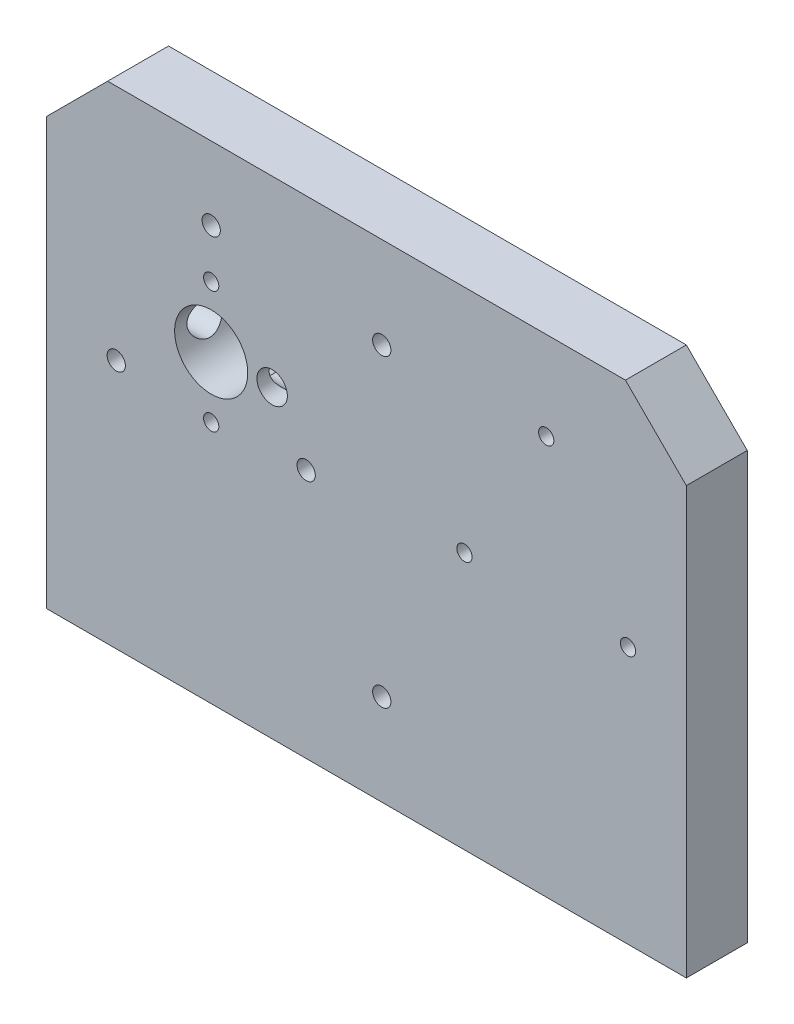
ISO-10303-21;
HEADER;
FILE_DESCRIPTION(('STEP AP214'),'2;1');
FILE_NAME('part.step','',(''),(''),'','','');
FILE_SCHEMA(('AUTOMOTIVE_DESIGN { 1 0 10303 214 1 1 1 1 }'));
ENDSEC;
DATA;
#1=APPLICATION_CONTEXT('core data for automotive mechanical design processes');
#2=APPLICATION_PROTOCOL_DEFINITION('international standard','automotive_design',2000,#1);
#3=PRODUCT_CONTEXT('',#1,'mechanical');
#4=PRODUCT('Part','Part','',(#3));
#5=PRODUCT_RELATED_PRODUCT_CATEGORY('part','',(#4));
#6=PRODUCT_DEFINITION_FORMATION('','',#4);
#7=PRODUCT_DEFINITION_CONTEXT('part definition',#1,'design');
#8=PRODUCT_DEFINITION('design','',#6,#7);
#9=PRODUCT_DEFINITION_SHAPE('','',#8);
#10=(LENGTH_UNIT() NAMED_UNIT(*) SI_UNIT(.MILLI.,.METRE.));
#11=(NAMED_UNIT(*) PLANE_ANGLE_UNIT() SI_UNIT($,.RADIAN.));
#12=(NAMED_UNIT(*) SI_UNIT($,.STERADIAN.) SOLID_ANGLE_UNIT());
#13=UNCERTAINTY_MEASURE_WITH_UNIT(LENGTH_MEASURE(1.E-05),#10,'distance_accuracy_value','');
#14=(GEOMETRIC_REPRESENTATION_CONTEXT(3) GLOBAL_UNCERTAINTY_ASSIGNED_CONTEXT((#13)) GLOBAL_UNIT_ASSIGNED_CONTEXT((#10,
#11,#12)) REPRESENTATION_CONTEXT('',''));
#15=CARTESIAN_POINT('',(0.,0.,0.));
#16=DIRECTION('',(0.,0.,1.));
#17=DIRECTION('',(1.,0.,0.));
#18=AXIS2_PLACEMENT_3D('',#15,#16,#17);
#19=CARTESIAN_POINT('',(52.5,40.,10.));
#20=DIRECTION('',(-1.,0.,0.));
#21=DIRECTION('',(0.,-1.,0.));
#22=AXIS2_PLACEMENT_3D('',#19,#20,#21);
#23=PLANE('',#22);
#24=DIRECTION('',(0.,1.,0.));
#25=VECTOR('',#24,1.);
#26=CARTESIAN_POINT('',(52.5,40.,0.));
#27=LINE('',#26,#25);
#28=CARTESIAN_POINT('',(52.5,-40.,0.));
#29=VERTEX_POINT('',#28);
#30=CARTESIAN_POINT('',(52.5,30.,0.));
#31=VERTEX_POINT('',#30);
#32=EDGE_CURVE('E343',#29,#31,#27,.T.);
#33=ORIENTED_EDGE('',*,*,#32,.T.);
#34=DIRECTION('',(0.,0.,1.));
#35=VECTOR('',#34,1.);
#36=CARTESIAN_POINT('',(52.5,30.,10.));
#37=LINE('',#36,#35);
#38=CARTESIAN_POINT('',(52.5,30.,10.));
#39=VERTEX_POINT('',#38);
#40=EDGE_CURVE('E11',#31,#39,#37,.T.);
#41=ORIENTED_EDGE('',*,*,#40,.T.);
#42=DIRECTION('',(0.,1.,0.));
#43=VECTOR('',#42,1.);
#44=CARTESIAN_POINT('',(52.5,40.,10.));
#45=LINE('',#44,#43);
#46=CARTESIAN_POINT('',(52.5,-40.,10.));
#47=VERTEX_POINT('',#46);
#48=EDGE_CURVE('E344',#47,#39,#45,.T.);
#49=ORIENTED_EDGE('',*,*,#48,.F.);
#50=DIRECTION('',(0.,0.,-1.));
#51=VECTOR('',#50,1.);
#52=CARTESIAN_POINT('',(52.5,-40.,10.));
#53=LINE('',#52,#51);
#54=EDGE_CURVE('E353',#47,#29,#53,.T.);
#55=ORIENTED_EDGE('',*,*,#54,.T.);
#56=EDGE_LOOP('',(#33,#41,#49,#55));
#57=FACE_BOUND('',#56,.T.);
#58=ADVANCED_FACE('F38',(#57),#23,.F.);
#59=CARTESIAN_POINT('',(-52.5,40.,10.));
#60=DIRECTION('',(0.,-1.,0.));
#61=DIRECTION('',(0.,0.,-1.));
#62=AXIS2_PLACEMENT_3D('',#59,#60,#61);
#63=PLANE('',#62);
#64=DIRECTION('',(-1.,0.,0.));
#65=VECTOR('',#64,1.);
#66=CARTESIAN_POINT('',(-52.5,40.,0.));
#67=LINE('',#66,#65);
#68=CARTESIAN_POINT('',(42.5,40.,0.));
#69=VERTEX_POINT('',#68);
#70=CARTESIAN_POINT('',(-42.5,40.,0.));
#71=VERTEX_POINT('',#70);
#72=EDGE_CURVE('E355',#69,#71,#67,.T.);
#73=ORIENTED_EDGE('',*,*,#72,.T.);
#74=DIRECTION('',(0.,0.,1.));
#75=VECTOR('',#74,1.);
#76=CARTESIAN_POINT('',(-42.5,40.,10.));
#77=LINE('',#76,#75);
#78=CARTESIAN_POINT('',(-42.5,40.,10.));
#79=VERTEX_POINT('',#78);
#80=EDGE_CURVE('E59',#71,#79,#77,.T.);
#81=ORIENTED_EDGE('',*,*,#80,.T.);
#82=DIRECTION('',(-1.,0.,0.));
#83=VECTOR('',#82,1.);
#84=CARTESIAN_POINT('',(-52.5,40.,10.));
#85=LINE('',#84,#83);
#86=CARTESIAN_POINT('',(42.5,40.,10.));
#87=VERTEX_POINT('',#86);
#88=EDGE_CURVE('E346',#87,#79,#85,.T.);
#89=ORIENTED_EDGE('',*,*,#88,.F.);
#90=DIRECTION('',(0.,0.,-1.));
#91=VECTOR('',#90,1.);
#92=CARTESIAN_POINT('',(42.5,40.,10.));
#93=LINE('',#92,#91);
#94=EDGE_CURVE('E467',#87,#69,#93,.T.);
#95=ORIENTED_EDGE('',*,*,#94,.T.);
#96=EDGE_LOOP('',(#73,#81,#89,#95));
#97=FACE_BOUND('',#96,.T.);
#98=ADVANCED_FACE('F260',(#97),#63,.F.);
#99=CARTESIAN_POINT('',(-52.5,40.,10.));
#100=DIRECTION('',(1.,0.,0.));
#101=DIRECTION('',(0.,0.,-1.));
#102=AXIS2_PLACEMENT_3D('',#99,#100,#101);
#103=PLANE('',#102);
#104=CARTESIAN_POINT('',(-52.5,15.,5.));
#105=DIRECTION('',(-1.,0.,0.));
#106=DIRECTION('',(0.,0.,1.));
#107=AXIS2_PLACEMENT_3D('',#104,#105,#106);
#108=CIRCLE('',#107,1.02499999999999);
#109=CARTESIAN_POINT('',(-52.5,15.,6.02499999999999));
#110=VERTEX_POINT('',#109);
#111=EDGE_CURVE('E129',#110,#110,#108,.T.);
#112=ORIENTED_EDGE('',*,*,#111,.F.);
#113=EDGE_LOOP('',(#112));
#114=FACE_BOUND('',#113,.T.);
#115=CARTESIAN_POINT('',(-52.5,5.,5.));
#116=DIRECTION('',(-1.,0.,0.));
#117=DIRECTION('',(0.,0.,1.));
#118=AXIS2_PLACEMENT_3D('',#115,#116,#117);
#119=CIRCLE('',#118,1.02499999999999);
#120=CARTESIAN_POINT('',(-52.5,5.,6.02499999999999));
#121=VERTEX_POINT('',#120);
#122=EDGE_CURVE('E128',#121,#121,#119,.T.);
#123=ORIENTED_EDGE('',*,*,#122,.F.);
#124=EDGE_LOOP('',(#123));
#125=FACE_BOUND('',#124,.T.);
#126=CARTESIAN_POINT('',(-52.5,10.,5.));
#127=DIRECTION('',(-1.,0.,0.));
#128=DIRECTION('',(0.,0.,1.));
#129=AXIS2_PLACEMENT_3D('',#126,#127,#128);
#130=CIRCLE('',#129,2.99999999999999);
#131=CARTESIAN_POINT('',(-52.5,10.,7.99999999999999));
#132=VERTEX_POINT('',#131);
#133=EDGE_CURVE('E332',#132,#132,#130,.T.);
#134=ORIENTED_EDGE('',*,*,#133,.F.);
#135=EDGE_LOOP('',(#134));
#136=FACE_BOUND('',#135,.T.);
#137=DIRECTION('',(0.,-1.,0.));
#138=VECTOR('',#137,1.);
#139=CARTESIAN_POINT('',(-52.5,40.,10.));
#140=LINE('',#139,#138);
#141=CARTESIAN_POINT('',(-52.5,30.,10.));
#142=VERTEX_POINT('',#141);
#143=CARTESIAN_POINT('',(-52.5,-40.,10.));
#144=VERTEX_POINT('',#143);
#145=EDGE_CURVE('E349',#142,#144,#140,.T.);
#146=ORIENTED_EDGE('',*,*,#145,.F.);
#147=DIRECTION('',(0.,0.,-1.));
#148=VECTOR('',#147,1.);
#149=CARTESIAN_POINT('',(-52.5,30.,10.));
#150=LINE('',#149,#148);
#151=CARTESIAN_POINT('',(-52.5,30.,0.));
#152=VERTEX_POINT('',#151);
#153=EDGE_CURVE('E290',#142,#152,#150,.T.);
#154=ORIENTED_EDGE('',*,*,#153,.T.);
#155=DIRECTION('',(0.,-1.,0.));
#156=VECTOR('',#155,1.);
#157=CARTESIAN_POINT('',(-52.5,40.,0.));
#158=LINE('',#157,#156);
#159=CARTESIAN_POINT('',(-52.5,-40.,0.));
#160=VERTEX_POINT('',#159);
#161=EDGE_CURVE('E357',#152,#160,#158,.T.);
#162=ORIENTED_EDGE('',*,*,#161,.T.);
#163=DIRECTION('',(0.,0.,-1.));
#164=VECTOR('',#163,1.);
#165=CARTESIAN_POINT('',(-52.5,-40.,10.));
#166=LINE('',#165,#164);
#167=EDGE_CURVE('E361',#144,#160,#166,.T.);
#168=ORIENTED_EDGE('',*,*,#167,.F.);
#169=EDGE_LOOP('',(#146,#154,#162,#168));
#170=FACE_BOUND('',#169,.T.);
#171=ADVANCED_FACE('F265',(#114,#125,#136,#170),#103,.F.);
#172=CARTESIAN_POINT('',(-52.5,-40.,10.));
#173=DIRECTION('',(0.,1.,0.));
#174=DIRECTION('',(0.,0.,1.));
#175=AXIS2_PLACEMENT_3D('',#172,#173,#174);
#176=PLANE('',#175);
#177=CARTESIAN_POINT('',(-37.5,-40.,5.));
#178=DIRECTION('',(0.,-1.,0.));
#179=DIRECTION('',(0.,0.,-1.));
#180=AXIS2_PLACEMENT_3D('',#177,#178,#179);
#181=CIRCLE('',#180,1.64999999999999);
#182=CARTESIAN_POINT('',(-37.5,-40.,3.35000000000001));
#183=VERTEX_POINT('',#182);
#184=EDGE_CURVE('E139',#183,#183,#181,.T.);
#185=ORIENTED_EDGE('',*,*,#184,.F.);
#186=EDGE_LOOP('',(#185));
#187=FACE_BOUND('',#186,.T.);
#188=CARTESIAN_POINT('',(37.5,-40.,5.));
#189=DIRECTION('',(0.,-1.,0.));
#190=DIRECTION('',(0.,0.,-1.));
#191=AXIS2_PLACEMENT_3D('',#188,#189,#190);
#192=CIRCLE('',#191,1.64999999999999);
#193=CARTESIAN_POINT('',(37.5,-40.,3.35000000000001));
#194=VERTEX_POINT('',#193);
#195=EDGE_CURVE('E145',#194,#194,#192,.T.);
#196=ORIENTED_EDGE('',*,*,#195,.F.);
#197=EDGE_LOOP('',(#196));
#198=FACE_BOUND('',#197,.T.);
#199=DIRECTION('',(1.,0.,0.));
#200=VECTOR('',#199,1.);
#201=CARTESIAN_POINT('',(-52.5,-40.,0.));
#202=LINE('',#201,#200);
#203=EDGE_CURVE('E347',#160,#29,#202,.T.);
#204=ORIENTED_EDGE('',*,*,#203,.T.);
#205=ORIENTED_EDGE('',*,*,#54,.F.);
#206=DIRECTION('',(1.,0.,0.));
#207=VECTOR('',#206,1.);
#208=CARTESIAN_POINT('',(-52.5,-40.,10.));
#209=LINE('',#208,#207);
#210=EDGE_CURVE('E351',#144,#47,#209,.T.);
#211=ORIENTED_EDGE('',*,*,#210,.F.);
#212=ORIENTED_EDGE('',*,*,#167,.T.);
#213=EDGE_LOOP('',(#204,#205,#211,#212));
#214=FACE_BOUND('',#213,.T.);
#215=ADVANCED_FACE('F450',(#187,#198,#214),#176,.F.);
#216=CARTESIAN_POINT('',(0.,0.,10.));
#217=DIRECTION('',(0.,0.,1.));
#218=DIRECTION('',(1.,0.,0.));
#219=AXIS2_PLACEMENT_3D('',#216,#217,#218);
#220=PLANE('',#219);
#221=CARTESIAN_POINT('',(2.5,-25.,10.));
#222=DIRECTION('',(0.,0.,1.));
#223=DIRECTION('',(1.,0.,0.));
#224=AXIS2_PLACEMENT_3D('',#221,#222,#223);
#225=CIRCLE('',#224,1.5);
#226=CARTESIAN_POINT('',(4.,-25.,10.));
#227=VERTEX_POINT('',#226);
#228=EDGE_CURVE('E151',#227,#227,#225,.T.);
#229=ORIENTED_EDGE('',*,*,#228,.F.);
#230=EDGE_LOOP('',(#229));
#231=FACE_BOUND('',#230,.T.);
#232=CARTESIAN_POINT('',(2.5,25.,10.));
#233=DIRECTION('',(0.,0.,1.));
#234=DIRECTION('',(1.,0.,0.));
#235=AXIS2_PLACEMENT_3D('',#232,#233,#234);
#236=CIRCLE('',#235,1.5);
#237=CARTESIAN_POINT('',(4.,25.,10.));
#238=VERTEX_POINT('',#237);
#239=EDGE_CURVE('E157',#238,#238,#236,.T.);
#240=ORIENTED_EDGE('',*,*,#239,.F.);
#241=EDGE_LOOP('',(#240));
#242=FACE_BOUND('',#241,.T.);
#243=CARTESIAN_POINT('',(16.0766062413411,2.25000000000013,10.));
#244=DIRECTION('',(0.,0.,1.));
#245=DIRECTION('',(1.,0.,0.));
#246=AXIS2_PLACEMENT_3D('',#243,#244,#245);
#247=CIRCLE('',#246,1.24999999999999);
#248=CARTESIAN_POINT('',(17.3266062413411,2.25000000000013,10.));
#249=VERTEX_POINT('',#248);
#250=EDGE_CURVE('E166',#249,#249,#247,.T.);
#251=ORIENTED_EDGE('',*,*,#250,.F.);
#252=EDGE_LOOP('',(#251));
#253=FACE_BOUND('',#252,.T.);
#254=CARTESIAN_POINT('',(42.9233937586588,2.24999999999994,10.));
#255=DIRECTION('',(0.,0.,1.));
#256=DIRECTION('',(1.,0.,0.));
#257=AXIS2_PLACEMENT_3D('',#254,#255,#256);
#258=CIRCLE('',#257,1.24999999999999);
#259=CARTESIAN_POINT('',(44.1733937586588,2.24999999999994,10.));
#260=VERTEX_POINT('',#259);
#261=EDGE_CURVE('E172',#260,#260,#258,.T.);
#262=ORIENTED_EDGE('',*,*,#261,.F.);
#263=EDGE_LOOP('',(#262));
#264=FACE_BOUND('',#263,.T.);
#265=CARTESIAN_POINT('',(29.5,25.5,10.));
#266=DIRECTION('',(0.,0.,1.));
#267=DIRECTION('',(1.,0.,0.));
#268=AXIS2_PLACEMENT_3D('',#265,#266,#267);
#269=CIRCLE('',#268,1.24999999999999);
#270=CARTESIAN_POINT('',(30.75,25.5,10.));
#271=VERTEX_POINT('',#270);
#272=EDGE_CURVE('E178',#271,#271,#269,.T.);
#273=ORIENTED_EDGE('',*,*,#272,.F.);
#274=EDGE_LOOP('',(#273));
#275=FACE_BOUND('',#274,.T.);
#276=CARTESIAN_POINT('',(-9.91154273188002,1.00000000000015,10.));
#277=DIRECTION('',(0.,0.,1.));
#278=DIRECTION('',(1.,0.,0.));
#279=AXIS2_PLACEMENT_3D('',#276,#277,#278);
#280=CIRCLE('',#279,1.49999999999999);
#281=CARTESIAN_POINT('',(-8.41154273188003,1.00000000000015,10.));
#282=VERTEX_POINT('',#281);
#283=EDGE_CURVE('E195',#282,#282,#280,.T.);
#284=ORIENTED_EDGE('',*,*,#283,.F.);
#285=EDGE_LOOP('',(#284));
#286=FACE_BOUND('',#285,.T.);
#287=CARTESIAN_POINT('',(-41.0884572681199,0.999999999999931,10.));
#288=DIRECTION('',(0.,0.,1.));
#289=DIRECTION('',(1.,0.,0.));
#290=AXIS2_PLACEMENT_3D('',#287,#288,#289);
#291=CIRCLE('',#290,1.49999999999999);
#292=CARTESIAN_POINT('',(-39.5884572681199,0.999999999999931,10.));
#293=VERTEX_POINT('',#292);
#294=EDGE_CURVE('E419',#293,#293,#291,.T.);
#295=ORIENTED_EDGE('',*,*,#294,.F.);
#296=EDGE_LOOP('',(#295));
#297=FACE_BOUND('',#296,.T.);
#298=CARTESIAN_POINT('',(-25.5,28.,10.));
#299=DIRECTION('',(0.,0.,1.));
#300=DIRECTION('',(1.,0.,0.));
#301=AXIS2_PLACEMENT_3D('',#298,#299,#300);
#302=CIRCLE('',#301,1.49999999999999);
#303=CARTESIAN_POINT('',(-24.,28.,10.));
#304=VERTEX_POINT('',#303);
#305=EDGE_CURVE('E427',#304,#304,#302,.T.);
#306=ORIENTED_EDGE('',*,*,#305,.F.);
#307=EDGE_LOOP('',(#306));
#308=FACE_BOUND('',#307,.T.);
#309=CARTESIAN_POINT('',(-25.5,20.,10.));
#310=DIRECTION('',(0.,0.,1.));
#311=DIRECTION('',(1.,0.,0.));
#312=AXIS2_PLACEMENT_3D('',#309,#310,#311);
#313=CIRCLE('',#312,1.24999999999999);
#314=CARTESIAN_POINT('',(-24.25,20.,10.));
#315=VERTEX_POINT('',#314);
#316=EDGE_CURVE('E433',#315,#315,#313,.T.);
#317=ORIENTED_EDGE('',*,*,#316,.F.);
#318=EDGE_LOOP('',(#317));
#319=FACE_BOUND('',#318,.T.);
#320=CARTESIAN_POINT('',(-25.5,0.,10.));
#321=DIRECTION('',(0.,0.,1.));
#322=DIRECTION('',(1.,0.,0.));
#323=AXIS2_PLACEMENT_3D('',#320,#321,#322);
#324=CIRCLE('',#323,1.24999999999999);
#325=CARTESIAN_POINT('',(-24.25,0.,10.));
#326=VERTEX_POINT('',#325);
#327=EDGE_CURVE('E439',#326,#326,#324,.T.);
#328=ORIENTED_EDGE('',*,*,#327,.F.);
#329=EDGE_LOOP('',(#328));
#330=FACE_BOUND('',#329,.T.);
#331=CARTESIAN_POINT('',(-15.5,10.,10.));
#332=DIRECTION('',(0.,0.,1.));
#333=DIRECTION('',(1.,0.,0.));
#334=AXIS2_PLACEMENT_3D('',#331,#332,#333);
#335=CIRCLE('',#334,2.49999999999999);
#336=CARTESIAN_POINT('',(-13.,10.,10.));
#337=VERTEX_POINT('',#336);
#338=EDGE_CURVE('E383',#337,#337,#335,.T.);
#339=ORIENTED_EDGE('',*,*,#338,.F.);
#340=EDGE_LOOP('',(#339));
#341=FACE_BOUND('',#340,.T.);
#342=CARTESIAN_POINT('',(-25.5,10.,10.));
#343=DIRECTION('',(0.,0.,1.));
#344=DIRECTION('',(1.,0.,0.));
#345=AXIS2_PLACEMENT_3D('',#342,#343,#344);
#346=CIRCLE('',#345,6.);
#347=CARTESIAN_POINT('',(-19.5,10.,10.));
#348=VERTEX_POINT('',#347);
#349=EDGE_CURVE('E322',#348,#348,#346,.T.);
#350=ORIENTED_EDGE('',*,*,#349,.F.);
#351=EDGE_LOOP('',(#350));
#352=FACE_BOUND('',#351,.T.);
#353=ORIENTED_EDGE('',*,*,#88,.T.);
#354=DIRECTION('',(0.707106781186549,0.707106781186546,0.));
#355=VECTOR('',#354,1.);
#356=CARTESIAN_POINT('',(-41.2499999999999,41.2500000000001,10.));
#357=LINE('',#356,#355);
#358=EDGE_CURVE('E46',#79,#142,#357,.F.);
#359=ORIENTED_EDGE('',*,*,#358,.T.);
#360=ORIENTED_EDGE('',*,*,#145,.T.);
#361=ORIENTED_EDGE('',*,*,#210,.T.);
#362=ORIENTED_EDGE('',*,*,#48,.T.);
#363=DIRECTION('',(0.707106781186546,-0.707106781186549,0.));
#364=VECTOR('',#363,1.);
#365=CARTESIAN_POINT('',(41.2500000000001,41.2499999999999,10.));
#366=LINE('',#365,#364);
#367=EDGE_CURVE('E459',#39,#87,#366,.F.);
#368=ORIENTED_EDGE('',*,*,#367,.T.);
#369=EDGE_LOOP('',(#353,#359,#360,#361,#362,#368));
#370=FACE_BOUND('',#369,.T.);
#371=ADVANCED_FACE('F310',(#231,#242,#253,#264,#275,#286,#297,#308,#319,#330,#341,#352,#370),
#220,.T.);
#372=CARTESIAN_POINT('',(0.,0.,0.));
#373=DIRECTION('',(0.,0.,1.));
#374=DIRECTION('',(1.,0.,0.));
#375=AXIS2_PLACEMENT_3D('',#372,#373,#374);
#376=PLANE('',#375);
#377=CARTESIAN_POINT('',(2.5,-25.,0.));
#378=DIRECTION('',(0.,0.,1.));
#379=DIRECTION('',(1.,0.,0.));
#380=AXIS2_PLACEMENT_3D('',#377,#378,#379);
#381=CIRCLE('',#380,1.5);
#382=CARTESIAN_POINT('',(4.,-25.,0.));
#383=VERTEX_POINT('',#382);
#384=EDGE_CURVE('E154',#383,#383,#381,.T.);
#385=ORIENTED_EDGE('',*,*,#384,.T.);
#386=EDGE_LOOP('',(#385));
#387=FACE_BOUND('',#386,.T.);
#388=CARTESIAN_POINT('',(2.5,25.,0.));
#389=DIRECTION('',(0.,0.,1.));
#390=DIRECTION('',(1.,0.,0.));
#391=AXIS2_PLACEMENT_3D('',#388,#389,#390);
#392=CIRCLE('',#391,1.5);
#393=CARTESIAN_POINT('',(4.,25.,0.));
#394=VERTEX_POINT('',#393);
#395=EDGE_CURVE('E160',#394,#394,#392,.T.);
#396=ORIENTED_EDGE('',*,*,#395,.T.);
#397=EDGE_LOOP('',(#396));
#398=FACE_BOUND('',#397,.T.);
#399=CARTESIAN_POINT('',(16.0766062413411,2.25000000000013,0.));
#400=DIRECTION('',(0.,0.,-1.));
#401=DIRECTION('',(-1.,0.,0.));
#402=AXIS2_PLACEMENT_3D('',#399,#400,#401);
#403=CIRCLE('',#402,1.24999999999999);
#404=CARTESIAN_POINT('',(14.8266062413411,2.25000000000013,0.));
#405=VERTEX_POINT('',#404);
#406=EDGE_CURVE('E163',#405,#405,#403,.T.);
#407=ORIENTED_EDGE('',*,*,#406,.F.);
#408=EDGE_LOOP('',(#407));
#409=FACE_BOUND('',#408,.T.);
#410=CARTESIAN_POINT('',(42.9233937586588,2.24999999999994,0.));
#411=DIRECTION('',(0.,0.,-1.));
#412=DIRECTION('',(-1.,0.,0.));
#413=AXIS2_PLACEMENT_3D('',#410,#411,#412);
#414=CIRCLE('',#413,1.24999999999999);
#415=CARTESIAN_POINT('',(41.6733937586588,2.24999999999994,0.));
#416=VERTEX_POINT('',#415);
#417=EDGE_CURVE('E169',#416,#416,#414,.T.);
#418=ORIENTED_EDGE('',*,*,#417,.F.);
#419=EDGE_LOOP('',(#418));
#420=FACE_BOUND('',#419,.T.);
#421=CARTESIAN_POINT('',(29.5,25.5,0.));
#422=DIRECTION('',(0.,0.,-1.));
#423=DIRECTION('',(-1.,0.,0.));
#424=AXIS2_PLACEMENT_3D('',#421,#422,#423);
#425=CIRCLE('',#424,1.24999999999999);
#426=CARTESIAN_POINT('',(28.25,25.5,0.));
#427=VERTEX_POINT('',#426);
#428=EDGE_CURVE('E175',#427,#427,#425,.T.);
#429=ORIENTED_EDGE('',*,*,#428,.F.);
#430=EDGE_LOOP('',(#429));
#431=FACE_BOUND('',#430,.T.);
#432=CARTESIAN_POINT('',(29.5,10.,0.));
#433=DIRECTION('',(0.,0.,-1.));
#434=DIRECTION('',(-1.,0.,0.));
#435=AXIS2_PLACEMENT_3D('',#432,#433,#434);
#436=CIRCLE('',#435,2.5);
#437=CARTESIAN_POINT('',(27.,10.,0.));
#438=VERTEX_POINT('',#437);
#439=EDGE_CURVE('E181',#438,#438,#436,.T.);
#440=ORIENTED_EDGE('',*,*,#439,.F.);
#441=EDGE_LOOP('',(#440));
#442=FACE_BOUND('',#441,.T.);
#443=CARTESIAN_POINT('',(-9.91154273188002,1.00000000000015,0.));
#444=DIRECTION('',(0.,0.,1.));
#445=DIRECTION('',(1.,0.,0.));
#446=AXIS2_PLACEMENT_3D('',#443,#444,#445);
#447=CIRCLE('',#446,1.49999999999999);
#448=CARTESIAN_POINT('',(-8.41154273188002,1.00000000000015,0.));
#449=VERTEX_POINT('',#448);
#450=EDGE_CURVE('E415',#449,#449,#447,.T.);
#451=ORIENTED_EDGE('',*,*,#450,.T.);
#452=EDGE_LOOP('',(#451));
#453=FACE_BOUND('',#452,.T.);
#454=CARTESIAN_POINT('',(-41.0884572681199,0.999999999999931,0.));
#455=DIRECTION('',(0.,0.,1.));
#456=DIRECTION('',(1.,0.,0.));
#457=AXIS2_PLACEMENT_3D('',#454,#455,#456);
#458=CIRCLE('',#457,1.49999999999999);
#459=CARTESIAN_POINT('',(-39.5884572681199,0.999999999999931,0.));
#460=VERTEX_POINT('',#459);
#461=EDGE_CURVE('E422',#460,#460,#458,.T.);
#462=ORIENTED_EDGE('',*,*,#461,.T.);
#463=EDGE_LOOP('',(#462));
#464=FACE_BOUND('',#463,.T.);
#465=CARTESIAN_POINT('',(-25.5,28.,0.));
#466=DIRECTION('',(0.,0.,1.));
#467=DIRECTION('',(1.,0.,0.));
#468=AXIS2_PLACEMENT_3D('',#465,#466,#467);
#469=CIRCLE('',#468,1.49999999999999);
#470=CARTESIAN_POINT('',(-24.,28.,0.));
#471=VERTEX_POINT('',#470);
#472=EDGE_CURVE('E430',#471,#471,#469,.T.);
#473=ORIENTED_EDGE('',*,*,#472,.T.);
#474=EDGE_LOOP('',(#473));
#475=FACE_BOUND('',#474,.T.);
#476=CARTESIAN_POINT('',(-25.5,20.,0.));
#477=DIRECTION('',(0.,0.,1.));
#478=DIRECTION('',(1.,0.,0.));
#479=AXIS2_PLACEMENT_3D('',#476,#477,#478);
#480=CIRCLE('',#479,1.24999999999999);
#481=CARTESIAN_POINT('',(-24.25,20.,0.));
#482=VERTEX_POINT('',#481);
#483=EDGE_CURVE('E436',#482,#482,#480,.T.);
#484=ORIENTED_EDGE('',*,*,#483,.T.);
#485=EDGE_LOOP('',(#484));
#486=FACE_BOUND('',#485,.T.);
#487=CARTESIAN_POINT('',(-25.5,0.,0.));
#488=DIRECTION('',(0.,0.,1.));
#489=DIRECTION('',(1.,0.,0.));
#490=AXIS2_PLACEMENT_3D('',#487,#488,#489);
#491=CIRCLE('',#490,1.24999999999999);
#492=CARTESIAN_POINT('',(-24.25,0.,0.));
#493=VERTEX_POINT('',#492);
#494=EDGE_CURVE('E385',#493,#493,#491,.T.);
#495=ORIENTED_EDGE('',*,*,#494,.T.);
#496=EDGE_LOOP('',(#495));
#497=FACE_BOUND('',#496,.T.);
#498=CARTESIAN_POINT('',(-25.5,10.,0.));
#499=DIRECTION('',(0.,0.,1.));
#500=DIRECTION('',(1.,0.,0.));
#501=AXIS2_PLACEMENT_3D('',#498,#499,#500);
#502=CIRCLE('',#501,6.);
#503=CARTESIAN_POINT('',(-19.5,10.,0.));
#504=VERTEX_POINT('',#503);
#505=EDGE_CURVE('E325',#504,#504,#502,.T.);
#506=ORIENTED_EDGE('',*,*,#505,.T.);
#507=EDGE_LOOP('',(#506));
#508=FACE_BOUND('',#507,.T.);
#509=ORIENTED_EDGE('',*,*,#161,.F.);
#510=DIRECTION('',(-0.707106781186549,-0.707106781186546,0.));
#511=VECTOR('',#510,1.);
#512=CARTESIAN_POINT('',(-52.5,30.,0.));
#513=LINE('',#512,#511);
#514=EDGE_CURVE('E469',#152,#71,#513,.F.);
#515=ORIENTED_EDGE('',*,*,#514,.T.);
#516=ORIENTED_EDGE('',*,*,#72,.F.);
#517=DIRECTION('',(-0.707106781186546,0.707106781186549,0.));
#518=VECTOR('',#517,1.);
#519=CARTESIAN_POINT('',(42.5,40.,0.));
#520=LINE('',#519,#518);
#521=EDGE_CURVE('E470',#69,#31,#520,.F.);
#522=ORIENTED_EDGE('',*,*,#521,.T.);
#523=ORIENTED_EDGE('',*,*,#32,.F.);
#524=ORIENTED_EDGE('',*,*,#203,.F.);
#525=EDGE_LOOP('',(#509,#515,#516,#522,#523,#524));
#526=FACE_BOUND('',#525,.T.);
#527=ADVANCED_FACE('F308',(#387,#398,#409,#420,#431,#442,#453,#464,#475,#486,#497,#508,#526),
#376,.F.);
#528=CARTESIAN_POINT('',(-25.5,10.,10.));
#529=DIRECTION('',(0.,0.,1.));
#530=DIRECTION('',(1.,0.,0.));
#531=AXIS2_PLACEMENT_3D('',#528,#529,#530);
#532=CYLINDRICAL_SURFACE('',#531,6.);
#533=CARTESIAN_POINT('',(-19.5,10.,2.00000000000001));
#534=CARTESIAN_POINT('',(-19.5000006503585,10.0788941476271,2.00000083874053));
#535=CARTESIAN_POINT('',(-19.5015613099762,10.157796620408,2.00311794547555));
#536=CARTESIAN_POINT('',(-19.5077564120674,10.3150019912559,2.01553927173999));
#537=CARTESIAN_POINT('',(-19.512392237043,10.3933046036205,2.02484627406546));
#538=CARTESIAN_POINT('',(-19.5307802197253,10.6266286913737,2.06195785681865));
#539=CARTESIAN_POINT('',(-19.549012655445,10.779952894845,2.0989528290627));
#540=CARTESIAN_POINT('',(-19.5955103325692,11.07683586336,2.19558177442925));
#541=CARTESIAN_POINT('',(-19.6237365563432,11.2204300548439,2.25512776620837));
#542=CARTESIAN_POINT('',(-19.6876269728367,11.4954082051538,2.39471125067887));
#543=CARTESIAN_POINT('',(-19.7232905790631,11.6267931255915,2.47474712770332));
#544=CARTESIAN_POINT('',(-19.8013124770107,11.8825270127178,2.65855398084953));
#545=CARTESIAN_POINT('',(-19.8439452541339,12.0059694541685,2.76346794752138));
#546=CARTESIAN_POINT('',(-19.9301996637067,12.2343345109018,2.99155592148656));
#547=CARTESIAN_POINT('',(-19.9738220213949,12.3392430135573,3.11474371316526));
#548=CARTESIAN_POINT('',(-20.0610365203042,12.5357686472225,3.38748436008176));
#549=CARTESIAN_POINT('',(-20.1043639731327,12.625724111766,3.53834097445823));
#550=CARTESIAN_POINT('',(-20.1621755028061,12.7403403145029,3.77595085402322));
#551=CARTESIAN_POINT('',(-20.1802542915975,12.7751678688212,3.85707092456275));
#552=CARTESIAN_POINT('',(-20.2133423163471,12.8376929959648,4.02260057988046));
#553=CARTESIAN_POINT('',(-20.2283533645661,12.8653947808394,4.10700818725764));
#554=CARTESIAN_POINT('',(-20.2538965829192,12.911882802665,4.27339579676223));
#555=CARTESIAN_POINT('',(-20.264641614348,12.9311004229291,4.3552227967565));
#556=CARTESIAN_POINT('',(-20.2824221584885,12.9626355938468,4.5205549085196));
#557=CARTESIAN_POINT('',(-20.2894596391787,12.9749568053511,4.60405910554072));
#558=CARTESIAN_POINT('',(-20.2995224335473,12.992513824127,4.77200636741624));
#559=CARTESIAN_POINT('',(-20.3025501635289,12.9977538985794,4.85644883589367));
#560=CARTESIAN_POINT('',(-20.3044744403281,13.0010845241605,5.02549365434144));
#561=CARTESIAN_POINT('',(-20.3033713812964,12.9991757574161,5.11009598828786));
#562=CARTESIAN_POINT('',(-20.2946533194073,12.984049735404,5.34275389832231));
#563=CARTESIAN_POINT('',(-20.2827320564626,12.9633504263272,5.49024415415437));
#564=CARTESIAN_POINT('',(-20.2477181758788,12.9008228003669,5.77919367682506));
#565=CARTESIAN_POINT('',(-20.2246219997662,12.8589877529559,5.92065100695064));
#566=CARTESIAN_POINT('',(-20.1693743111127,12.754628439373,6.19767965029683));
#567=CARTESIAN_POINT('',(-20.13702440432,12.6916449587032,6.33303711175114));
#568=CARTESIAN_POINT('',(-20.0668982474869,12.547125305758,6.59190496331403));
#569=CARTESIAN_POINT('',(-20.0291195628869,12.4655808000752,6.71540999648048));
#570=CARTESIAN_POINT('',(-19.9466051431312,12.2741980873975,6.9635630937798));
#571=CARTESIAN_POINT('',(-19.9015946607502,12.1620833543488,7.0863704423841));
#572=CARTESIAN_POINT('',(-19.8135713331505,11.918666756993,7.31220643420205));
#573=CARTESIAN_POINT('',(-19.7705594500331,11.7873557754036,7.41522562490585));
#574=CARTESIAN_POINT('',(-19.6889403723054,11.501549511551,7.60305693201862));
#575=CARTESIAN_POINT('',(-19.6506304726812,11.3462607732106,7.68680140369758));
#576=CARTESIAN_POINT('',(-19.5852635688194,11.0213986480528,7.8262911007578));
#577=CARTESIAN_POINT('',(-19.5581976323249,10.8518367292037,7.88205855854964));
#578=CARTESIAN_POINT('',(-19.5202699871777,10.518299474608,7.9594262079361));
#579=CARTESIAN_POINT('',(-19.5082518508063,10.3550245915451,7.98347370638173));
#580=CARTESIAN_POINT('',(-19.4978095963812,10.0263387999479,8.00439419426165));
#581=CARTESIAN_POINT('',(-19.4993790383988,9.86092894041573,8.00128005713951));
#582=CARTESIAN_POINT('',(-19.5152642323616,9.54630108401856,7.96937993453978));
#583=CARTESIAN_POINT('',(-19.5285826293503,9.39682177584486,7.94260240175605));
#584=CARTESIAN_POINT('',(-19.5653348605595,9.10477932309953,7.86728578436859));
#585=CARTESIAN_POINT('',(-19.588769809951,8.96221694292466,7.81874430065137));
#586=CARTESIAN_POINT('',(-19.6444724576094,8.68333417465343,7.70000460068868));
#587=CARTESIAN_POINT('',(-19.6769735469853,8.54730880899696,7.62922684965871));
#588=CARTESIAN_POINT('',(-19.7476807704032,8.28861591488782,7.46867739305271));
#589=CARTESIAN_POINT('',(-19.7858893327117,8.16595411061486,7.37889759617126));
#590=CARTESIAN_POINT('',(-19.868753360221,7.92469693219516,7.17271872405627));
#591=CARTESIAN_POINT('',(-19.9136734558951,7.80768376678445,7.0545713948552));
#592=CARTESIAN_POINT('',(-20.002128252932,7.59443103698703,6.80022454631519));
#593=CARTESIAN_POINT('',(-20.0456619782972,7.4982058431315,6.66401264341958));
#594=CARTESIAN_POINT('',(-20.1284642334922,7.32487625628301,6.36906903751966));
#595=CARTESIAN_POINT('',(-20.1674241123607,7.2489235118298,6.20956620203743));
#596=CARTESIAN_POINT('',(-20.2327778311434,7.12575152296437,5.87746979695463));
#597=CARTESIAN_POINT('',(-20.2591878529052,7.07849525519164,5.7048934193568));
#598=CARTESIAN_POINT('',(-20.2931549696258,7.0184149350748,5.36926933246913));
#599=CARTESIAN_POINT('',(-20.3022784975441,7.00272100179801,5.20689724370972));
#600=CARTESIAN_POINT('',(-20.3050393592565,6.99793254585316,4.88165879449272));
#601=CARTESIAN_POINT('',(-20.2986834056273,7.0088264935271,4.71879267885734));
#602=CARTESIAN_POINT('',(-20.272864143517,7.0542215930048,4.41354950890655));
#603=CARTESIAN_POINT('',(-20.2547071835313,7.08637494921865,4.27069863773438));
#604=CARTESIAN_POINT('',(-20.2088694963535,7.17047403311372,3.9925755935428));
#605=CARTESIAN_POINT('',(-20.1811857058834,7.22242612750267,3.85730587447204));
#606=CARTESIAN_POINT('',(-20.1171441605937,7.34855233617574,3.58812563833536));
#607=CARTESIAN_POINT('',(-20.0803286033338,7.4239849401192,3.45491703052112));
#608=CARTESIAN_POINT('',(-20.0029397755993,7.59354873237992,3.2021756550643));
#609=CARTESIAN_POINT('',(-19.9623645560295,7.68768964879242,3.0826500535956));
#610=CARTESIAN_POINT('',(-19.8761314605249,7.90538310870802,2.84557714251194));
#611=CARTESIAN_POINT('',(-19.8304550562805,8.03111947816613,2.73003487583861));
#612=CARTESIAN_POINT('',(-19.7436628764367,8.3015628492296,2.52119885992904));
#613=CARTESIAN_POINT('',(-19.7025495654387,8.44628001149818,2.42791710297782));
#614=CARTESIAN_POINT('',(-19.6474859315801,8.67547666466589,2.30682181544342));
#615=CARTESIAN_POINT('',(-19.6301747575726,8.75424685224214,2.26947979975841));
#616=CARTESIAN_POINT('',(-19.5983115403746,8.91520274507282,2.20163832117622));
#617=CARTESIAN_POINT('',(-19.5837581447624,8.9973867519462,2.17113550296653));
#618=CARTESIAN_POINT('',(-19.5578730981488,9.16438300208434,2.11739274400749));
#619=CARTESIAN_POINT('',(-19.5465344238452,9.24918905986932,2.09413695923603));
#620=CARTESIAN_POINT('',(-19.5273922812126,9.42085764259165,2.05511742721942));
#621=CARTESIAN_POINT('',(-19.5195866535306,9.5077188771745,2.03934910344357));
#622=CARTESIAN_POINT('',(-19.5091417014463,9.66217510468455,2.01831532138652));
#623=CARTESIAN_POINT('',(-19.5057196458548,9.72950483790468,2.01145308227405));
#624=CARTESIAN_POINT('',(-19.5011484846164,9.86455432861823,2.00229499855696));
#625=CARTESIAN_POINT('',(-19.4999994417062,9.93227409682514,1.99999927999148));
#626=CARTESIAN_POINT('',(-19.5,10.,2.00000000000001));
#627=B_SPLINE_CURVE_WITH_KNOTS('',3,(#533,#534,#535,#536,#537,#538,#539,#540,#541,#542,#543,
#544,#545,#546,#547,#548,#549,#550,#551,#552,#553,#554,#555,#556,#557,#558,#559,#560,#561,#562,
#563,#564,#565,#566,#567,#568,#569,#570,#571,#572,#573,#574,#575,#576,#577,#578,#579,#580,#581,
#582,#583,#584,#585,#586,#587,#588,#589,#590,#591,#592,#593,#594,#595,#596,#597,#598,#599,#600,
#601,#602,#603,#604,#605,#606,#607,#608,#609,#610,#611,#612,#613,#614,#615,#616,#617,#618,#619,
#620,#621,#622,#623,#624,#625,#626),.UNSPECIFIED.,.T.,.F.,(4,2,2,2,2,2,2,2,2,2,2,2,2,2,2,2,2,2,
2,2,2,2,2,2,2,2,2,2,2,2,2,2,2,2,2,2,2,2,2,2,2,2,2,2,2,2,4),(0.,0.236611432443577,
0.473329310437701,0.947100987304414,1.41904300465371,1.89094781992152,2.39140181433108,
2.89223525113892,3.43190833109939,3.70192714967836,3.97178599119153,4.22563720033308,
4.4793535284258,4.73291689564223,4.98645606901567,5.43238672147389,5.87845946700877,
6.33492255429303,6.79159098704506,7.30616358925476,7.82098138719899,8.35970601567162,
8.89800185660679,9.39171406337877,9.88519228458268,10.3404225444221,10.7957029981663,
11.2640010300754,11.7324988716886,12.2470036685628,12.7618630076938,13.3016558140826,
13.8407507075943,14.3280945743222,14.8152271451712,15.2559532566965,15.6968212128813,
16.1673090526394,16.6380421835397,17.1659726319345,17.6941868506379,17.9605054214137,
18.2266930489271,18.4922945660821,18.7577335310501,18.9608446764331,19.1639614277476),.UNSPECIFIED.);
#628=CARTESIAN_POINT('',(-19.5,10.,2.00000000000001));
#629=VERTEX_POINT('',#628);
#630=EDGE_CURVE('E318',#629,#629,#627,.T.);
#631=ORIENTED_EDGE('',*,*,#630,.T.);
#632=EDGE_LOOP('',(#631));
#633=FACE_BOUND('',#632,.T.);
#634=CARTESIAN_POINT('',(-31.5,10.,7.99999999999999));
#635=CARTESIAN_POINT('',(-31.4999993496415,10.0788941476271,7.99999916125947));
#636=CARTESIAN_POINT('',(-31.4984386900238,10.157796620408,7.99688205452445));
#637=CARTESIAN_POINT('',(-31.4922435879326,10.3150019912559,7.98446072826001));
#638=CARTESIAN_POINT('',(-31.487607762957,10.3933046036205,7.97515372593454));
#639=CARTESIAN_POINT('',(-31.4692197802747,10.6266286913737,7.93804214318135));
#640=CARTESIAN_POINT('',(-31.450987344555,10.779952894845,7.9010471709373));
#641=CARTESIAN_POINT('',(-31.4044896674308,11.07683586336,7.80441822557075));
#642=CARTESIAN_POINT('',(-31.3762634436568,11.2204300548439,7.74487223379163));
#643=CARTESIAN_POINT('',(-31.3123730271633,11.4954082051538,7.60528874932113));
#644=CARTESIAN_POINT('',(-31.2767094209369,11.6267931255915,7.52525287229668));
#645=CARTESIAN_POINT('',(-31.1986875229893,11.8825270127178,7.34144601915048));
#646=CARTESIAN_POINT('',(-31.1560547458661,12.0059694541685,7.23653205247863));
#647=CARTESIAN_POINT('',(-31.0698003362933,12.2343345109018,7.00844407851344));
#648=CARTESIAN_POINT('',(-31.0261779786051,12.3392430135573,6.88525628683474));
#649=CARTESIAN_POINT('',(-30.9389634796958,12.5357686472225,6.61251563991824));
#650=CARTESIAN_POINT('',(-30.8956360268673,12.625724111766,6.46165902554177));
#651=CARTESIAN_POINT('',(-30.8378244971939,12.7403403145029,6.22404914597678));
#652=CARTESIAN_POINT('',(-30.8197457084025,12.7751678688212,6.14292907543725));
#653=CARTESIAN_POINT('',(-30.7866576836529,12.8376929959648,5.97739942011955));
#654=CARTESIAN_POINT('',(-30.7716466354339,12.8653947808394,5.89299181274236));
#655=CARTESIAN_POINT('',(-30.7461034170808,12.911882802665,5.72660420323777));
#656=CARTESIAN_POINT('',(-30.735358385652,12.9311004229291,5.64477720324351));
#657=CARTESIAN_POINT('',(-30.7175778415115,12.9626355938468,5.4794450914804));
#658=CARTESIAN_POINT('',(-30.7105403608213,12.9749568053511,5.39594089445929));
#659=CARTESIAN_POINT('',(-30.7004775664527,12.992513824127,5.22799363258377));
#660=CARTESIAN_POINT('',(-30.6974498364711,12.9977538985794,5.14355116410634));
#661=CARTESIAN_POINT('',(-30.6955255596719,13.0010845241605,4.97450634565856));
#662=CARTESIAN_POINT('',(-30.6966286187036,12.9991757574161,4.88990401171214));
#663=CARTESIAN_POINT('',(-30.7053466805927,12.984049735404,4.65724610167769));
#664=CARTESIAN_POINT('',(-30.7172679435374,12.9633504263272,4.50975584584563));
#665=CARTESIAN_POINT('',(-30.7522818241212,12.9008228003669,4.22080632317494));
#666=CARTESIAN_POINT('',(-30.7753780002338,12.8589877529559,4.07934899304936));
#667=CARTESIAN_POINT('',(-30.8306256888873,12.754628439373,3.80232034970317));
#668=CARTESIAN_POINT('',(-30.86297559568,12.6916449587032,3.66696288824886));
#669=CARTESIAN_POINT('',(-30.9331017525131,12.547125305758,3.40809503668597));
#670=CARTESIAN_POINT('',(-30.9708804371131,12.4655808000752,3.28459000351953));
#671=CARTESIAN_POINT('',(-31.0533948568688,12.2741980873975,3.0364369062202));
#672=CARTESIAN_POINT('',(-31.0984053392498,12.1620833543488,2.9136295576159));
#673=CARTESIAN_POINT('',(-31.1864286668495,11.918666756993,2.68779356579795));
#674=CARTESIAN_POINT('',(-31.2294405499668,11.7873557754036,2.58477437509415));
#675=CARTESIAN_POINT('',(-31.3110596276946,11.501549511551,2.39694306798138));
#676=CARTESIAN_POINT('',(-31.3493695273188,11.3462607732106,2.31319859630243));
#677=CARTESIAN_POINT('',(-31.4147364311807,11.0213986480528,2.1737088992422));
#678=CARTESIAN_POINT('',(-31.4418023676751,10.8518367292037,2.11794144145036));
#679=CARTESIAN_POINT('',(-31.4797300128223,10.518299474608,2.0405737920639));
#680=CARTESIAN_POINT('',(-31.4917481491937,10.3550245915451,2.01652629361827));
#681=CARTESIAN_POINT('',(-31.5021904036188,10.0263387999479,1.99560580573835));
#682=CARTESIAN_POINT('',(-31.5006209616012,9.86092894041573,1.99871994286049));
#683=CARTESIAN_POINT('',(-31.4847357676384,9.54630108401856,2.03062006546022));
#684=CARTESIAN_POINT('',(-31.4714173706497,9.39682177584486,2.05739759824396));
#685=CARTESIAN_POINT('',(-31.4346651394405,9.10477932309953,2.13271421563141));
#686=CARTESIAN_POINT('',(-31.411230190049,8.96221694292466,2.18125569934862));
#687=CARTESIAN_POINT('',(-31.3555275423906,8.68333417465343,2.29999539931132));
#688=CARTESIAN_POINT('',(-31.3230264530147,8.54730880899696,2.3707731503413));
#689=CARTESIAN_POINT('',(-31.2523192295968,8.28861591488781,2.53132260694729));
#690=CARTESIAN_POINT('',(-31.2141106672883,8.16595411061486,2.62110240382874));
#691=CARTESIAN_POINT('',(-31.1312466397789,7.92469693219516,2.82728127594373));
#692=CARTESIAN_POINT('',(-31.0863265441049,7.80768376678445,2.9454286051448));
#693=CARTESIAN_POINT('',(-30.997871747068,7.59443103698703,3.19977545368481));
#694=CARTESIAN_POINT('',(-30.9543380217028,7.4982058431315,3.33598735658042));
#695=CARTESIAN_POINT('',(-30.8715357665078,7.32487625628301,3.63093096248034));
#696=CARTESIAN_POINT('',(-30.8325758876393,7.2489235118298,3.79043379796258));
#697=CARTESIAN_POINT('',(-30.7672221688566,7.12575152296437,4.12253020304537));
#698=CARTESIAN_POINT('',(-30.7408121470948,7.07849525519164,4.2951065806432));
#699=CARTESIAN_POINT('',(-30.7068450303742,7.0184149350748,4.63073066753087));
#700=CARTESIAN_POINT('',(-30.6977215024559,7.00272100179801,4.79310275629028));
#701=CARTESIAN_POINT('',(-30.6949606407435,6.99793254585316,5.11834120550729));
#702=CARTESIAN_POINT('',(-30.7013165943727,7.0088264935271,5.28120732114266));
#703=CARTESIAN_POINT('',(-30.727135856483,7.0542215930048,5.58645049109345));
#704=CARTESIAN_POINT('',(-30.7452928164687,7.08637494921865,5.72930136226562));
#705=CARTESIAN_POINT('',(-30.7911305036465,7.17047403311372,6.0074244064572));
#706=CARTESIAN_POINT('',(-30.8188142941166,7.22242612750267,6.14269412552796));
#707=CARTESIAN_POINT('',(-30.8828558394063,7.34855233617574,6.41187436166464));
#708=CARTESIAN_POINT('',(-30.9196713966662,7.4239849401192,6.54508296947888));
#709=CARTESIAN_POINT('',(-30.9970602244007,7.59354873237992,6.7978243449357));
#710=CARTESIAN_POINT('',(-31.0376354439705,7.68768964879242,6.9173499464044));
#711=CARTESIAN_POINT('',(-31.1238685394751,7.90538310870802,7.15442285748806));
#712=CARTESIAN_POINT('',(-31.1695449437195,8.03111947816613,7.26996512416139));
#713=CARTESIAN_POINT('',(-31.2563371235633,8.3015628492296,7.47880114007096));
#714=CARTESIAN_POINT('',(-31.2974504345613,8.44628001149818,7.57208289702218));
#715=CARTESIAN_POINT('',(-31.3525140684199,8.67547666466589,7.69317818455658));
#716=CARTESIAN_POINT('',(-31.3698252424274,8.75424685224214,7.73052020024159));
#717=CARTESIAN_POINT('',(-31.4016884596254,8.91520274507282,7.79836167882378));
#718=CARTESIAN_POINT('',(-31.4162418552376,8.9973867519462,7.82886449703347));
#719=CARTESIAN_POINT('',(-31.4421269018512,9.16438300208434,7.88260725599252));
#720=CARTESIAN_POINT('',(-31.4534655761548,9.24918905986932,7.90586304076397));
#721=CARTESIAN_POINT('',(-31.4726077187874,9.42085764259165,7.94488257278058));
#722=CARTESIAN_POINT('',(-31.4804133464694,9.5077188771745,7.96065089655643));
#723=CARTESIAN_POINT('',(-31.4908582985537,9.66217510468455,7.98168467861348));
#724=CARTESIAN_POINT('',(-31.4942803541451,9.72950483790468,7.98854691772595));
#725=CARTESIAN_POINT('',(-31.4988515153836,9.86455432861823,7.99770500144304));
#726=CARTESIAN_POINT('',(-31.5000005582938,9.93227409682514,8.00000072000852));
#727=CARTESIAN_POINT('',(-31.5,10.,7.99999999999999));
#728=B_SPLINE_CURVE_WITH_KNOTS('',3,(#634,#635,#636,#637,#638,#639,#640,#641,#642,#643,#644,
#645,#646,#647,#648,#649,#650,#651,#652,#653,#654,#655,#656,#657,#658,#659,#660,#661,#662,#663,
#664,#665,#666,#667,#668,#669,#670,#671,#672,#673,#674,#675,#676,#677,#678,#679,#680,#681,#682,
#683,#684,#685,#686,#687,#688,#689,#690,#691,#692,#693,#694,#695,#696,#697,#698,#699,#700,#701,
#702,#703,#704,#705,#706,#707,#708,#709,#710,#711,#712,#713,#714,#715,#716,#717,#718,#719,#720,
#721,#722,#723,#724,#725,#726,#727),.UNSPECIFIED.,.T.,.F.,(4,2,2,2,2,2,2,2,2,2,2,2,2,2,2,2,2,2,
2,2,2,2,2,2,2,2,2,2,2,2,2,2,2,2,2,2,2,2,2,2,2,2,2,2,2,2,4),(0.,0.236611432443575,
0.473329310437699,0.947100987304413,1.41904300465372,1.89094781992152,2.39140181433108,
2.89223525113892,3.43190833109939,3.70192714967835,3.97178599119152,4.22563720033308,
4.47935352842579,4.73291689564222,4.98645606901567,5.43238672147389,5.87845946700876,
6.33492255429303,6.79159098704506,7.30616358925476,7.82098138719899,8.35970601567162,
8.89800185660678,9.39171406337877,9.88519228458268,10.3404225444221,10.7957029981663,
11.2640010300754,11.7324988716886,12.2470036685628,12.7618630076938,13.3016558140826,
13.8407507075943,14.3280945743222,14.8152271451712,15.2559532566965,15.6968212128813,
16.1673090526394,16.6380421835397,17.1659726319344,17.6941868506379,17.9605054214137,
18.2266930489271,18.4922945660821,18.7577335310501,18.9608446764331,19.1639614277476),.UNSPECIFIED.);
#729=CARTESIAN_POINT('',(-31.5,10.,7.99999999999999));
#730=VERTEX_POINT('',#729);
#731=EDGE_CURVE('E314',#730,#730,#728,.T.);
#732=ORIENTED_EDGE('',*,*,#731,.T.);
#733=EDGE_LOOP('',(#732));
#734=FACE_BOUND('',#733,.T.);
#735=ORIENTED_EDGE('',*,*,#505,.F.);
#736=EDGE_LOOP('',(#735));
#737=FACE_BOUND('',#736,.T.);
#738=ORIENTED_EDGE('',*,*,#349,.T.);
#739=EDGE_LOOP('',(#738));
#740=FACE_BOUND('',#739,.T.);
#741=ADVANCED_FACE('F302',(#633,#734,#737,#740),#532,.F.);
#742=CARTESIAN_POINT('',(-52.5,10.,5.));
#743=DIRECTION('',(-1.,0.,0.));
#744=DIRECTION('',(0.,0.,1.));
#745=AXIS2_PLACEMENT_3D('',#742,#743,#744);
#746=CYLINDRICAL_SURFACE('',#745,2.99999999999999);
#747=ORIENTED_EDGE('',*,*,#133,.T.);
#748=EDGE_LOOP('',(#747));
#749=FACE_BOUND('',#748,.T.);
#750=ORIENTED_EDGE('',*,*,#731,.F.);
#751=EDGE_LOOP('',(#750));
#752=FACE_BOUND('',#751,.T.);
#753=ADVANCED_FACE('F307',(#749,#752),#746,.F.);
#754=CARTESIAN_POINT('',(-13.,10.,7.99999999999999));
#755=CARTESIAN_POINT('',(-13.0000048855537,10.1187575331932,7.99999522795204));
#756=CARTESIAN_POINT('',(-13.0085225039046,10.2375512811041,7.99288670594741));
#757=CARTESIAN_POINT('',(-13.0419627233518,10.4711824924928,7.96510762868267));
#758=CARTESIAN_POINT('',(-13.0668974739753,10.5860169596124,7.94442702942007));
#759=CARTESIAN_POINT('',(-13.1313121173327,10.8078299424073,7.89142690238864));
#760=CARTESIAN_POINT('',(-13.1707050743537,10.9148509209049,7.85917696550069));
#761=CARTESIAN_POINT('',(-13.2620170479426,11.1198413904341,7.78529176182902));
#762=CARTESIAN_POINT('',(-13.3139402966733,11.2178078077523,7.74365332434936));
#763=CARTESIAN_POINT('',(-13.4494537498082,11.4378999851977,7.63674191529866));
#764=CARTESIAN_POINT('',(-13.5376702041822,11.5556821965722,7.5684054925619));
#765=CARTESIAN_POINT('',(-13.7305243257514,11.7720239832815,7.42422624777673));
#766=CARTESIAN_POINT('',(-13.8352075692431,11.870528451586,7.34836281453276));
#767=CARTESIAN_POINT('',(-14.0040842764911,12.0043726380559,7.23294886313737));
#768=CARTESIAN_POINT('',(-14.0629555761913,12.0469972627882,7.19383679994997));
#769=CARTESIAN_POINT('',(-14.1845056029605,12.1271529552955,7.11620611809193));
#770=CARTESIAN_POINT('',(-14.2471855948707,12.1646823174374,7.07768770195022));
#771=CARTESIAN_POINT('',(-14.3762673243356,12.2344112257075,7.00250543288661));
#772=CARTESIAN_POINT('',(-14.4426597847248,12.2666233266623,6.9658373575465));
#773=CARTESIAN_POINT('',(-14.5794462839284,12.3255369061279,6.89577686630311));
#774=CARTESIAN_POINT('',(-14.6498368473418,12.3522430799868,6.86238167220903));
#775=CARTESIAN_POINT('',(-14.8016670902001,12.40193513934,6.79791918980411));
#776=CARTESIAN_POINT('',(-14.8835240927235,12.424338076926,6.76736311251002));
#777=CARTESIAN_POINT('',(-15.0518897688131,12.461013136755,6.71593180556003));
#778=CARTESIAN_POINT('',(-15.1383865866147,12.4753049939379,6.69503310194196));
#779=CARTESIAN_POINT('',(-15.3157654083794,12.4948107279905,6.66620928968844));
#780=CARTESIAN_POINT('',(-15.4066879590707,12.4999120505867,6.65844510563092));
#781=CARTESIAN_POINT('',(-15.5885626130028,12.5000856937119,6.65818308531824));
#782=CARTESIAN_POINT('',(-15.6795147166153,12.495157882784,6.66568544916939));
#783=CARTESIAN_POINT('',(-15.8655247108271,12.4750526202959,6.69541639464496));
#784=CARTESIAN_POINT('',(-15.960293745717,12.4590557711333,6.71881932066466));
#785=CARTESIAN_POINT('',(-16.1442109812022,12.4174255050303,6.77688235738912));
#786=CARTESIAN_POINT('',(-16.2333393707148,12.3917601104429,6.81157977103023));
#787=CARTESIAN_POINT('',(-16.3878270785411,12.3381627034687,6.88002226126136));
#788=CARTESIAN_POINT('',(-16.4543122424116,12.3117751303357,6.91250316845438));
#789=CARTESIAN_POINT('',(-16.5836508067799,12.2540442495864,6.98021996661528));
#790=CARTESIAN_POINT('',(-16.6465020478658,12.2226980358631,7.01545746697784));
#791=CARTESIAN_POINT('',(-16.8299668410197,12.1214967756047,7.12342648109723));
#792=CARTESIAN_POINT('',(-16.9454141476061,12.0445066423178,7.19837696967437));
#793=CARTESIAN_POINT('',(-17.1682669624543,11.8676591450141,7.35079897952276));
#794=CARTESIAN_POINT('',(-17.2749383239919,11.7668180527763,7.42819792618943));
#795=CARTESIAN_POINT('',(-17.4711123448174,11.5448438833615,7.57509054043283));
#796=CARTESIAN_POINT('',(-17.5606520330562,11.4237556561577,7.64460112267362));
#797=CARTESIAN_POINT('',(-17.6994148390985,11.1941117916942,7.75428914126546));
#798=CARTESIAN_POINT('',(-17.7531428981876,11.0897273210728,7.79748350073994));
#799=CARTESIAN_POINT('',(-17.8463427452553,10.8710714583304,7.873078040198));
#800=CARTESIAN_POINT('',(-17.8858234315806,10.7568062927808,7.90548495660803));
#801=CARTESIAN_POINT('',(-17.9484172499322,10.5199543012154,7.95709834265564));
#802=CARTESIAN_POINT('',(-17.9714039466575,10.3973109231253,7.97620280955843));
#803=CARTESIAN_POINT('',(-17.9987092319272,10.1485599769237,7.99891434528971));
#804=CARTESIAN_POINT('',(-18.0030403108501,10.022454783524,8.00253178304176));
#805=CARTESIAN_POINT('',(-17.9933375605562,9.78668980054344,7.99444999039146));
#806=CARTESIAN_POINT('',(-17.9814413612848,9.67686945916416,7.98453350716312));
#807=CARTESIAN_POINT('',(-17.9437330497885,9.46135503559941,7.95325589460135));
#808=CARTESIAN_POINT('',(-17.917919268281,9.35566145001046,7.93189339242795));
#809=CARTESIAN_POINT('',(-17.8533766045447,9.14943450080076,7.87889521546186));
#810=CARTESIAN_POINT('',(-17.8144792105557,9.0489893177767,7.84712564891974));
#811=CARTESIAN_POINT('',(-17.7256043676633,8.85634099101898,7.77536124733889));
#812=CARTESIAN_POINT('',(-17.6756228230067,8.76414091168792,7.73536337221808));
#813=CARTESIAN_POINT('',(-17.541568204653,8.54932560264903,7.62975152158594));
#814=CARTESIAN_POINT('',(-17.4522674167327,8.43165640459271,7.56070244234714));
#815=CARTESIAN_POINT('',(-17.2571596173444,8.21571005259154,7.41522445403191));
#816=CARTESIAN_POINT('',(-17.1513015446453,8.11749509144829,7.33877300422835));
#817=CARTESIAN_POINT('',(-16.9805880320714,7.98426685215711,7.22269805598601));
#818=CARTESIAN_POINT('',(-16.921101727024,7.94188930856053,7.1834115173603));
#819=CARTESIAN_POINT('',(-16.7982791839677,7.86228330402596,7.10553153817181));
#820=CARTESIAN_POINT('',(-16.7349415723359,7.82505669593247,7.06693835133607));
#821=CARTESIAN_POINT('',(-16.6045115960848,7.75601142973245,6.9917610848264));
#822=CARTESIAN_POINT('',(-16.5374297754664,7.72417851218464,6.95517188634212));
#823=CARTESIAN_POINT('',(-16.3992098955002,7.66611143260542,6.88547561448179));
#824=CARTESIAN_POINT('',(-16.3280756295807,7.63987214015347,6.85236536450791));
#825=CARTESIAN_POINT('',(-16.1757296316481,7.5916264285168,6.78925557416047));
#826=CARTESIAN_POINT('',(-16.0941655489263,7.57011685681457,6.75970711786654));
#827=CARTESIAN_POINT('',(-15.9265480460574,7.53517744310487,6.71043063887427));
#828=CARTESIAN_POINT('',(-15.8405064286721,7.52172742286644,6.69067811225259));
#829=CARTESIAN_POINT('',(-15.6643623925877,7.50382710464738,6.66415315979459));
#830=CARTESIAN_POINT('',(-15.5742246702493,7.49948200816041,6.65753251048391));
#831=CARTESIAN_POINT('',(-15.3941467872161,7.50061802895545,6.65924308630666));
#832=CARTESIAN_POINT('',(-15.3042066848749,7.50610173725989,6.66757825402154));
#833=CARTESIAN_POINT('',(-15.1183274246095,7.5273473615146,6.69892898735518));
#834=CARTESIAN_POINT('',(-15.0227697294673,7.54414187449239,6.72341371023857));
#835=CARTESIAN_POINT('',(-14.8374687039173,7.58749660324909,6.78358728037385));
#836=CARTESIAN_POINT('',(-14.7477457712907,7.61408911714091,6.81931312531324));
#837=CARTESIAN_POINT('',(-14.5922109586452,7.66949164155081,6.88952619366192));
#838=CARTESIAN_POINT('',(-14.5252562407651,7.69674146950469,6.92277816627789));
#839=CARTESIAN_POINT('',(-14.3950536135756,7.75629372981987,6.99195185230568));
#840=CARTESIAN_POINT('',(-14.3318078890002,7.78859909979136,7.02787511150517));
#841=CARTESIAN_POINT('',(-14.1472704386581,7.89283705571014,7.1377593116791));
#842=CARTESIAN_POINT('',(-14.0312530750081,7.97206423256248,7.21379780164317));
#843=CARTESIAN_POINT('',(-13.8079927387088,8.15370302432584,7.36772603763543));
#844=CARTESIAN_POINT('',(-13.7014582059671,8.25706040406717,7.44552394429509));
#845=CARTESIAN_POINT('',(-13.5061362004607,8.48446445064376,7.59256498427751));
#846=CARTESIAN_POINT('',(-13.4173094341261,8.60846416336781,7.66182692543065));
#847=CARTESIAN_POINT('',(-13.2816858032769,8.84144481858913,7.76942305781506));
#848=CARTESIAN_POINT('',(-13.2299614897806,8.94600122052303,7.8111217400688));
#849=CARTESIAN_POINT('',(-13.1407813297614,9.1645602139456,7.8836146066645));
#850=CARTESIAN_POINT('',(-13.1033064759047,9.27854997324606,7.91442331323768));
#851=CARTESIAN_POINT('',(-13.0498115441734,9.49337996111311,7.95858745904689));
#852=CARTESIAN_POINT('',(-13.0312248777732,9.59315453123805,7.97402142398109));
#853=CARTESIAN_POINT('',(-13.0063176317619,9.79527727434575,7.99472922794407));
#854=CARTESIAN_POINT('',(-12.9999957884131,9.89762518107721,8.0000041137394));
#855=CARTESIAN_POINT('',(-13.,10.,7.99999999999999));
#856=B_SPLINE_CURVE_WITH_KNOTS('',3,(#754,#755,#756,#757,#758,#759,#760,#761,#762,#763,#764,
#765,#766,#767,#768,#769,#770,#771,#772,#773,#774,#775,#776,#777,#778,#779,#780,#781,#782,#783,
#784,#785,#786,#787,#788,#789,#790,#791,#792,#793,#794,#795,#796,#797,#798,#799,#800,#801,#802,
#803,#804,#805,#806,#807,#808,#809,#810,#811,#812,#813,#814,#815,#816,#817,#818,#819,#820,#821,
#822,#823,#824,#825,#826,#827,#828,#829,#830,#831,#832,#833,#834,#835,#836,#837,#838,#839,#840,
#841,#842,#843,#844,#845,#846,#847,#848,#849,#850,#851,#852,#853,#854,#855),.UNSPECIFIED.,.T.,
.F.,(4,2,2,2,2,2,2,2,2,2,2,2,2,2,2,2,2,2,2,2,2,2,2,2,2,2,2,2,2,2,2,2,2,2,2,2,2,2,2,2,2,2,2,2,2,
2,2,2,2,2,4),(0.,0.355841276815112,0.711946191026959,1.0659440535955,1.42006164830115,
1.90425178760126,2.38980643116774,2.63722280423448,2.88472179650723,3.13162777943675,
3.37832232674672,3.64812890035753,3.91727616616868,4.18969776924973,4.46212294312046,
4.7572352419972,5.05333228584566,5.28870178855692,5.5242097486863,5.99549339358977,
6.49137310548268,6.98616858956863,7.36002155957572,7.73364063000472,8.11009395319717,
8.48629519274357,8.81743460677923,9.14861374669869,9.48423297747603,9.8199764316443,
10.3065635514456,10.7946819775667,11.0432812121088,11.2919696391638,11.5399899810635,
11.7877818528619,12.0551105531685,12.3217671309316,12.5914881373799,12.8612802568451,
13.1598101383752,13.4593330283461,13.6977271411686,13.9362602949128,14.4135864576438,
14.9143001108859,15.4138899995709,15.7841228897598,16.1538601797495,16.4606444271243,
16.7673970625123),.UNSPECIFIED.);
#857=CARTESIAN_POINT('',(-13.,10.,7.99999999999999));
#858=VERTEX_POINT('',#857);
#859=EDGE_CURVE('E337',#858,#858,#856,.T.);
#860=ORIENTED_EDGE('',*,*,#859,.T.);
#861=EDGE_LOOP('',(#860));
#862=FACE_BOUND('',#861,.T.);
#863=CARTESIAN_POINT('',(29.5,10.,5.));
#864=DIRECTION('',(-1.,0.,0.));
#865=DIRECTION('',(0.,0.,1.));
#866=AXIS2_PLACEMENT_3D('',#863,#864,#865);
#867=CIRCLE('',#866,2.99999999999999);
#868=CARTESIAN_POINT('',(29.5,7.5,3.34168760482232));
#869=VERTEX_POINT('',#868);
#870=CARTESIAN_POINT('',(29.5,12.5,3.34168760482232));
#871=VERTEX_POINT('',#870);
#872=EDGE_CURVE('E328',#869,#871,#867,.T.);
#873=ORIENTED_EDGE('',*,*,#872,.F.);
#874=CARTESIAN_POINT('',(29.5,7.5,3.34168760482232));
#875=CARTESIAN_POINT('',(29.4553323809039,7.49998946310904,3.34171976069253));
#876=CARTESIAN_POINT('',(29.4106853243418,7.5011966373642,3.33988372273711));
#877=CARTESIAN_POINT('',(29.321881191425,7.50596054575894,3.33272682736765));
#878=CARTESIAN_POINT('',(29.277723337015,7.50951275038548,3.32741268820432));
#879=CARTESIAN_POINT('',(29.1908134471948,7.51881276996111,3.31365101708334));
#880=CARTESIAN_POINT('',(29.1480502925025,7.52452762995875,3.30525056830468));
#881=CARTESIAN_POINT('',(29.0634831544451,7.53803168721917,3.28569098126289));
#882=CARTESIAN_POINT('',(29.0216797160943,7.5458220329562,3.27453031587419));
#883=CARTESIAN_POINT('',(28.8652735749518,7.57905430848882,3.22777305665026));
#884=CARTESIAN_POINT('',(28.7544090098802,7.61111734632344,3.18421753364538));
#885=CARTESIAN_POINT('',(28.541332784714,7.6882969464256,3.08690941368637));
#886=CARTESIAN_POINT('',(28.4392026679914,7.73352212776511,3.03307330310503));
#887=CARTESIAN_POINT('',(28.2709128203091,7.82154860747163,2.93666193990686));
#888=CARTESIAN_POINT('',(28.2026527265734,7.86152160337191,2.89512255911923));
#889=CARTESIAN_POINT('',(28.0705478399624,7.94746839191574,2.81122687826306));
#890=CARTESIAN_POINT('',(28.0067049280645,7.99344471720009,2.76887023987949));
#891=CARTESIAN_POINT('',(27.8220995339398,8.14007664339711,2.64262072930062));
#892=CARTESIAN_POINT('',(27.7077977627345,8.24967833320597,2.55926614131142));
#893=CARTESIAN_POINT('',(27.5214151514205,8.46667683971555,2.41892336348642));
#894=CARTESIAN_POINT('',(27.4455188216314,8.56962819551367,2.360089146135));
#895=CARTESIAN_POINT('',(27.3086766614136,8.78970064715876,2.2522531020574));
#896=CARTESIAN_POINT('',(27.2477099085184,8.90680156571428,2.2032375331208));
#897=CARTESIAN_POINT('',(27.1528864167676,9.13207111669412,2.12627018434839));
#898=CARTESIAN_POINT('',(27.1161648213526,9.23828295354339,2.09614169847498));
#899=CARTESIAN_POINT('',(27.0570188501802,9.45716955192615,2.04739555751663));
#900=CARTESIAN_POINT('',(27.034585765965,9.56984033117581,2.02877089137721));
#901=CARTESIAN_POINT('',(27.0053985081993,9.79909377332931,2.00450840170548));
#902=CARTESIAN_POINT('',(26.9987101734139,9.91569080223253,1.99892511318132));
#903=CARTESIAN_POINT('',(27.0017022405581,10.1485273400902,2.00141856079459));
#904=CARTESIAN_POINT('',(27.0113822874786,10.2647668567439,2.00949500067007));
#905=CARTESIAN_POINT('',(27.0452142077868,10.4854457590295,2.0375866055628));
#906=CARTESIAN_POINT('',(27.0683509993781,10.5901534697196,2.05676395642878));
#907=CARTESIAN_POINT('',(27.1269476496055,10.7936257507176,2.10498672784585));
#908=CARTESIAN_POINT('',(27.1624093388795,10.8923894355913,2.13403361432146));
#909=CARTESIAN_POINT('',(27.2475913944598,11.0905341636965,2.20309712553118));
#910=CARTESIAN_POINT('',(27.298272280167,11.1892447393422,2.2438397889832));
#911=CARTESIAN_POINT('',(27.4103973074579,11.3767800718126,2.33255285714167));
#912=CARTESIAN_POINT('',(27.4718510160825,11.4655959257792,2.38052968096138));
#913=CARTESIAN_POINT('',(27.6354591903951,11.6728036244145,2.50551198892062));
#914=CARTESIAN_POINT('',(27.743070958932,11.7851738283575,2.58547189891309));
#915=CARTESIAN_POINT('',(27.9172398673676,11.9367015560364,2.70796027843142));
#916=CARTESIAN_POINT('',(27.9775138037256,11.9844271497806,2.74927352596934));
#917=CARTESIAN_POINT('',(28.1022717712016,12.0741868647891,2.83171614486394));
#918=CARTESIAN_POINT('',(28.1667542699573,12.1162230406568,2.87284557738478));
#919=CARTESIAN_POINT('',(28.3311070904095,12.2128219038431,2.97263331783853));
#920=CARTESIAN_POINT('',(28.4334383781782,12.2640644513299,3.03050586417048));
#921=CARTESIAN_POINT('',(28.6478377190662,12.3531315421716,3.13784941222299));
#922=CARTESIAN_POINT('',(28.7598793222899,12.390991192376,3.18734221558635));
#923=CARTESIAN_POINT('',(28.9576318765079,12.4418792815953,3.25687478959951));
#924=CARTESIAN_POINT('',(29.0407214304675,12.458967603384,3.28128825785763));
#925=CARTESIAN_POINT('',(29.2106172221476,12.4846653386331,3.31863921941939));
#926=CARTESIAN_POINT('',(29.2974082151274,12.4933065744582,3.33161976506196));
#927=CARTESIAN_POINT('',(29.4039274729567,12.4982281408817,3.33901988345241));
#928=CARTESIAN_POINT('',(29.4231185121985,12.4988919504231,3.34001859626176));
#929=CARTESIAN_POINT('',(29.4615376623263,12.499777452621,3.34135153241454));
#930=CARTESIAN_POINT('',(29.4807657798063,12.4999990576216,3.34168562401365));
#931=CARTESIAN_POINT('',(29.5,12.5,3.34168760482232));
#932=B_SPLINE_CURVE_WITH_KNOTS('',3,(#874,#875,#876,#877,#878,#879,#880,#881,#882,#883,#884,
#885,#886,#887,#888,#889,#890,#891,#892,#893,#894,#895,#896,#897,#898,#899,#900,#901,#902,#903,
#904,#905,#906,#907,#908,#909,#910,#911,#912,#913,#914,#915,#916,#917,#918,#919,#920,#921,#922,
#923,#924,#925,#926,#927,#928,#929,#930,#931),.UNSPECIFIED.,.F.,.F.,(4,2,2,2,2,2,2,2,2,2,2,2,2,
2,2,2,2,2,2,2,2,2,2,2,2,2,2,2,4),(0.,0.133915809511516,0.267573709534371,0.399271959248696,
0.531043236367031,0.898867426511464,1.26981755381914,1.53753000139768,1.80535575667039,
2.33924592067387,2.76010881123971,3.18037848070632,3.5279765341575,3.87536253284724,
4.22419861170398,4.57302712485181,4.89843954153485,5.22390031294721,5.57721326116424,
5.93084158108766,6.45264424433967,6.71427180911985,6.97580463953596,7.35949670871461,
7.74217465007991,8.00607441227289,8.26897611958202,8.32665105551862,8.38433742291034),.UNSPECIFIED.);
#933=EDGE_CURVE('E187',#869,#871,#932,.T.);
#934=ORIENTED_EDGE('',*,*,#933,.T.);
#935=EDGE_LOOP('',(#873,#934));
#936=FACE_BOUND('',#935,.T.);
#937=ORIENTED_EDGE('',*,*,#630,.F.);
#938=EDGE_LOOP('',(#937));
#939=FACE_BOUND('',#938,.T.);
#940=ADVANCED_FACE('F271',(#862,#936,#939),#746,.F.);
#941=CARTESIAN_POINT('',(29.5,10.,5.));
#942=DIRECTION('',(-1.,0.,0.));
#943=DIRECTION('',(0.,0.,1.));
#944=AXIS2_PLACEMENT_3D('',#941,#942,#943);
#945=CONICAL_SURFACE('',#944,2.99999999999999,1.02974425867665);
#946=ORIENTED_EDGE('',*,*,#872,.T.);
#947=CARTESIAN_POINT('',(29.3195418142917,12.493478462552,2.83788017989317));
#948=CARTESIAN_POINT('',(29.3482635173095,12.4955622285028,2.91327298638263));
#949=CARTESIAN_POINT('',(29.3764176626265,12.4970957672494,2.98890110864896));
#950=CARTESIAN_POINT('',(29.4312831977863,12.4992049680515,3.14071410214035));
#951=CARTESIAN_POINT('',(29.457994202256,12.4997803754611,3.21689911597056));
#952=CARTESIAN_POINT('',(29.5098112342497,12.5001159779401,3.3703488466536));
#953=CARTESIAN_POINT('',(29.5349062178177,12.499871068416,3.44761733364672));
#954=CARTESIAN_POINT('',(29.5828831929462,12.4987413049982,3.60282509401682));
#955=CARTESIAN_POINT('',(29.6057653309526,12.497856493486,3.68076432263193));
#956=CARTESIAN_POINT('',(29.6692775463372,12.4946132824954,3.91170277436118));
#957=CARTESIAN_POINT('',(29.706152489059,12.4916532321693,4.0657694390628));
#958=CARTESIAN_POINT('',(29.7650336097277,12.4860955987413,4.37643076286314));
#959=CARTESIAN_POINT('',(29.7870825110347,12.4834969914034,4.53301681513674));
#960=CARTESIAN_POINT('',(29.8078078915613,12.4809903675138,4.79140954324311));
#961=CARTESIAN_POINT('',(29.8120253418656,12.4804522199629,4.89276217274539));
#962=CARTESIAN_POINT('',(29.8122638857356,12.4804212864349,5.04517996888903));
#963=CARTESIAN_POINT('',(29.8113128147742,12.4805423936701,5.09625331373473));
#964=CARTESIAN_POINT('',(29.8073876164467,12.4810309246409,5.19830973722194));
#965=CARTESIAN_POINT('',(29.8044139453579,12.4813982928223,5.24929283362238));
#966=CARTESIAN_POINT('',(29.8004482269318,12.4818805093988,5.30019999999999));
#967=B_SPLINE_CURVE_WITH_KNOTS('',3,(#947,#948,#949,#950,#951,#952,#953,#954,#955,#956,#957,
#958,#959,#960,#961,#962,#963,#964,#965,#966),.UNSPECIFIED.,.F.,.F.,(4,2,2,2,2,2,2,2,2,4),(0.,
0.242116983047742,0.484298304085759,0.727989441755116,0.971664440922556,1.44649450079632,
1.91995033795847,2.22393897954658,2.37714904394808,2.5303245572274),.UNSPECIFIED.);
#968=CARTESIAN_POINT('',(29.8121885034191,12.4804310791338,5.));
#969=VERTEX_POINT('',#968);
#970=EDGE_CURVE('E283',#871,#969,#967,.T.);
#971=ORIENTED_EDGE('',*,*,#970,.T.);
#972=DIRECTION('',(-0.515038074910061,0.857167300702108,0.));
#973=VECTOR('',#972,1.);
#974=CARTESIAN_POINT('',(31.3025818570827,10.,5.));
#975=LINE('',#974,#973);
#976=CARTESIAN_POINT('',(31.3025818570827,10.,5.));
#977=VERTEX_POINT('',#976);
#978=EDGE_CURVE('E291',#969,#977,#975,.F.);
#979=ORIENTED_EDGE('',*,*,#978,.T.);
#980=DIRECTION('',(0.515038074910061,0.857167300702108,0.));
#981=VECTOR('',#980,1.);
#982=CARTESIAN_POINT('',(31.3025818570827,10.,5.));
#983=LINE('',#982,#981);
#984=CARTESIAN_POINT('',(29.8121885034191,7.51956892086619,5.));
#985=VERTEX_POINT('',#984);
#986=EDGE_CURVE('E367',#977,#985,#983,.F.);
#987=ORIENTED_EDGE('',*,*,#986,.T.);
#988=CARTESIAN_POINT('',(29.6539673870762,7.50474569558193,6.14100778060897));
#989=CARTESIAN_POINT('',(29.6718150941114,7.50584562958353,6.07198091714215));
#990=CARTESIAN_POINT('',(29.6885350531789,7.50707117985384,6.00264773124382));
#991=CARTESIAN_POINT('',(29.7193061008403,7.509590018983,5.86334043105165));
#992=CARTESIAN_POINT('',(29.7333551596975,7.51088335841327,5.79336587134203));
#993=CARTESIAN_POINT('',(29.7582981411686,7.51334765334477,5.65310281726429));
#994=CARTESIAN_POINT('',(29.7692031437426,7.51451902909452,5.58281633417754));
#995=CARTESIAN_POINT('',(29.7875234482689,7.51657208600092,5.44180708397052));
#996=CARTESIAN_POINT('',(29.7949398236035,7.51745385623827,5.37108445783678));
#997=CARTESIAN_POINT('',(29.8088390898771,7.51913344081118,5.19222283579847));
#998=CARTESIAN_POINT('',(29.8128027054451,7.5196458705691,5.08387015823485));
#999=CARTESIAN_POINT('',(29.811417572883,7.5194722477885,4.86721804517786));
#1000=CARTESIAN_POINT('',(29.8060673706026,7.51878600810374,4.7589186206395));
#1001=CARTESIAN_POINT('',(29.7866324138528,7.51646757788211,4.54301500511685));
#1002=CARTESIAN_POINT('',(29.7725374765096,7.51483428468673,4.43541177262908));
#1003=CARTESIAN_POINT('',(29.7369108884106,7.51118718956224,4.2214433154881));
#1004=CARTESIAN_POINT('',(29.715376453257,7.50917324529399,4.11507856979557));
#1005=CARTESIAN_POINT('',(29.6677492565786,7.5055266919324,3.90961323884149));
#1006=CARTESIAN_POINT('',(29.6419760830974,7.50387911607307,3.81043729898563));
#1007=CARTESIAN_POINT('',(29.5863095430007,7.50133503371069,3.61326905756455));
#1008=CARTESIAN_POINT('',(29.5564168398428,7.50043840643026,3.51527656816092));
#1009=CARTESIAN_POINT('',(29.4934173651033,7.49980994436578,3.32021626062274));
#1010=CARTESIAN_POINT('',(29.4603071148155,7.50007938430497,3.22314957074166));
#1011=CARTESIAN_POINT('',(29.3916266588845,7.50211345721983,3.02988750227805));
#1012=CARTESIAN_POINT('',(29.3560559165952,7.50387841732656,2.93369231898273));
#1013=CARTESIAN_POINT('',(29.2687976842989,7.51019471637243,2.70472878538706));
#1014=CARTESIAN_POINT('',(29.2162316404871,7.51556388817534,2.57231716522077));
#1015=CARTESIAN_POINT('',(29.1085581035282,7.53023676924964,2.30874152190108));
#1016=CARTESIAN_POINT('',(29.0534503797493,7.53954083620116,2.17757761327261));
#1017=CARTESIAN_POINT('',(28.9414669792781,7.56251991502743,1.91639953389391));
#1018=CARTESIAN_POINT('',(28.8845914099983,7.57619466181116,1.78638529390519));
#1019=CARTESIAN_POINT('',(28.7696392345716,7.60831939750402,1.52748354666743));
#1020=CARTESIAN_POINT('',(28.7115626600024,7.6267692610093,1.39859600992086));
#1021=CARTESIAN_POINT('',(28.5948075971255,7.66880534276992,1.14235717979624));
#1022=CARTESIAN_POINT('',(28.5361311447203,7.69237763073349,1.01500268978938));
#1023=CARTESIAN_POINT('',(28.4184066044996,7.74515766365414,0.761659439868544));
#1024=CARTESIAN_POINT('',(28.3593585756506,7.77436453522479,0.635670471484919));
#1025=CARTESIAN_POINT('',(28.2411388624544,7.83902088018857,0.385102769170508));
#1026=CARTESIAN_POINT('',(28.1819671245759,7.87447954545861,0.260526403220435));
#1027=CARTESIAN_POINT('',(28.0639334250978,7.95239978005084,0.0133507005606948));
#1028=CARTESIAN_POINT('',(28.0050716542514,7.99486523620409,-0.10924749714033));
#1029=CARTESIAN_POINT('',(27.9465710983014,8.04120990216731,-0.230598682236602));
#1030=B_SPLINE_CURVE_WITH_KNOTS('',3,(#988,#989,#990,#991,#992,#993,#994,#995,#996,#997,#998,
#999,#1000,#1001,#1002,#1003,#1004,#1005,#1006,#1007,#1008,#1009,#1010,#1011,#1012,#1013,#1014,
#1015,#1016,#1017,#1018,#1019,#1020,#1021,#1022,#1023,#1024,#1025,#1026,#1027,#1028,#1029),
.UNSPECIFIED.,.F.,.F.,(4,2,2,2,2,2,2,2,2,2,2,2,2,2,2,2,2,2,2,2,4),(0.,0.213930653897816,
0.428023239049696,0.641351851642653,0.854614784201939,1.17947480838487,1.50438555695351,
1.82967536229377,2.15508704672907,2.46242576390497,2.7697150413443,3.07734032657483,
3.38503291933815,3.81263737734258,4.24028071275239,4.66789811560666,5.09550428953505,
5.5219618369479,5.94835333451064,6.37537705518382,6.80263845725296),.UNSPECIFIED.);
#1031=EDGE_CURVE('E275',#985,#869,#1030,.T.);
#1032=ORIENTED_EDGE('',*,*,#1031,.T.);
#1033=EDGE_LOOP('',(#946,#971,#979,#987,#1032));
#1034=FACE_BOUND('',#1033,.T.);
#1035=ADVANCED_FACE('F293',(#1034),#945,.F.);
#1036=CARTESIAN_POINT('',(-15.5,10.,10.));
#1037=DIRECTION('',(0.,0.,1.));
#1038=DIRECTION('',(1.,0.,0.));
#1039=AXIS2_PLACEMENT_3D('',#1036,#1037,#1038);
#1040=CYLINDRICAL_SURFACE('',#1039,2.49999999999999);
#1041=ORIENTED_EDGE('',*,*,#859,.F.);
#1042=EDGE_LOOP('',(#1041));
#1043=FACE_BOUND('',#1042,.T.);
#1044=ORIENTED_EDGE('',*,*,#338,.T.);
#1045=EDGE_LOOP('',(#1044));
#1046=FACE_BOUND('',#1045,.T.);
#1047=ADVANCED_FACE('F298',(#1043,#1046),#1040,.F.);
#1048=CARTESIAN_POINT('',(-25.5,0.,10.));
#1049=DIRECTION('',(0.,0.,1.));
#1050=DIRECTION('',(1.,0.,0.));
#1051=AXIS2_PLACEMENT_3D('',#1048,#1049,#1050);
#1052=CYLINDRICAL_SURFACE('',#1051,1.24999999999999);
#1053=ORIENTED_EDGE('',*,*,#494,.F.);
#1054=EDGE_LOOP('',(#1053));
#1055=FACE_BOUND('',#1054,.T.);
#1056=ORIENTED_EDGE('',*,*,#327,.T.);
#1057=EDGE_LOOP('',(#1056));
#1058=FACE_BOUND('',#1057,.T.);
#1059=ADVANCED_FACE('F393',(#1055,#1058),#1052,.F.);
#1060=CARTESIAN_POINT('',(-25.5,20.,10.));
#1061=DIRECTION('',(0.,0.,1.));
#1062=DIRECTION('',(1.,0.,0.));
#1063=AXIS2_PLACEMENT_3D('',#1060,#1061,#1062);
#1064=CYLINDRICAL_SURFACE('',#1063,1.24999999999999);
#1065=ORIENTED_EDGE('',*,*,#483,.F.);
#1066=EDGE_LOOP('',(#1065));
#1067=FACE_BOUND('',#1066,.T.);
#1068=ORIENTED_EDGE('',*,*,#316,.T.);
#1069=EDGE_LOOP('',(#1068));
#1070=FACE_BOUND('',#1069,.T.);
#1071=ADVANCED_FACE('F396',(#1067,#1070),#1064,.F.);
#1072=CARTESIAN_POINT('',(-25.5,28.,10.));
#1073=DIRECTION('',(0.,0.,1.));
#1074=DIRECTION('',(1.,0.,0.));
#1075=AXIS2_PLACEMENT_3D('',#1072,#1073,#1074);
#1076=CYLINDRICAL_SURFACE('',#1075,1.49999999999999);
#1077=ORIENTED_EDGE('',*,*,#472,.F.);
#1078=EDGE_LOOP('',(#1077));
#1079=FACE_BOUND('',#1078,.T.);
#1080=ORIENTED_EDGE('',*,*,#305,.T.);
#1081=EDGE_LOOP('',(#1080));
#1082=FACE_BOUND('',#1081,.T.);
#1083=ADVANCED_FACE('F400',(#1079,#1082),#1076,.F.);
#1084=CARTESIAN_POINT('',(-41.0884572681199,0.999999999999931,10.));
#1085=DIRECTION('',(0.,0.,1.));
#1086=DIRECTION('',(1.,0.,0.));
#1087=AXIS2_PLACEMENT_3D('',#1084,#1085,#1086);
#1088=CYLINDRICAL_SURFACE('',#1087,1.49999999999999);
#1089=ORIENTED_EDGE('',*,*,#461,.F.);
#1090=EDGE_LOOP('',(#1089));
#1091=FACE_BOUND('',#1090,.T.);
#1092=ORIENTED_EDGE('',*,*,#294,.T.);
#1093=EDGE_LOOP('',(#1092));
#1094=FACE_BOUND('',#1093,.T.);
#1095=ADVANCED_FACE('F404',(#1091,#1094),#1088,.F.);
#1096=CARTESIAN_POINT('',(-9.91154273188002,1.00000000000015,10.));
#1097=DIRECTION('',(0.,0.,1.));
#1098=DIRECTION('',(1.,0.,0.));
#1099=AXIS2_PLACEMENT_3D('',#1096,#1097,#1098);
#1100=CYLINDRICAL_SURFACE('',#1099,1.49999999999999);
#1101=ORIENTED_EDGE('',*,*,#450,.F.);
#1102=EDGE_LOOP('',(#1101));
#1103=FACE_BOUND('',#1102,.T.);
#1104=ORIENTED_EDGE('',*,*,#283,.T.);
#1105=EDGE_LOOP('',(#1104));
#1106=FACE_BOUND('',#1105,.T.);
#1107=ADVANCED_FACE('F208',(#1103,#1106),#1100,.F.);
#1108=CARTESIAN_POINT('',(29.5,10.,5.));
#1109=DIRECTION('',(0.,0.,1.));
#1110=DIRECTION('',(1.,0.,0.));
#1111=AXIS2_PLACEMENT_3D('',#1108,#1109,#1110);
#1112=PLANE('',#1111);
#1113=CARTESIAN_POINT('',(29.5,10.,5.));
#1114=DIRECTION('',(0.,0.,-1.));
#1115=DIRECTION('',(-1.,0.,0.));
#1116=AXIS2_PLACEMENT_3D('',#1113,#1114,#1115);
#1117=CIRCLE('',#1116,2.5);
#1118=EDGE_CURVE('E184',#969,#985,#1117,.T.);
#1119=ORIENTED_EDGE('',*,*,#1118,.T.);
#1120=ORIENTED_EDGE('',*,*,#986,.F.);
#1121=ORIENTED_EDGE('',*,*,#978,.F.);
#1122=EDGE_LOOP('',(#1119,#1120,#1121));
#1123=FACE_BOUND('',#1122,.T.);
#1124=ADVANCED_FACE('F204',(#1123),#1112,.F.);
#1125=CARTESIAN_POINT('',(29.5,10.,0.));
#1126=DIRECTION('',(0.,0.,-1.));
#1127=DIRECTION('',(-1.,0.,0.));
#1128=AXIS2_PLACEMENT_3D('',#1125,#1126,#1127);
#1129=CYLINDRICAL_SURFACE('',#1128,2.5);
#1130=ORIENTED_EDGE('',*,*,#1031,.F.);
#1131=ORIENTED_EDGE('',*,*,#1118,.F.);
#1132=ORIENTED_EDGE('',*,*,#970,.F.);
#1133=ORIENTED_EDGE('',*,*,#933,.F.);
#1134=EDGE_LOOP('',(#1130,#1131,#1132,#1133));
#1135=FACE_BOUND('',#1134,.T.);
#1136=ORIENTED_EDGE('',*,*,#439,.T.);
#1137=EDGE_LOOP('',(#1136));
#1138=FACE_BOUND('',#1137,.T.);
#1139=ADVANCED_FACE('F199',(#1135,#1138),#1129,.F.);
#1140=CARTESIAN_POINT('',(29.5,25.5,0.));
#1141=DIRECTION('',(0.,0.,-1.));
#1142=DIRECTION('',(-1.,0.,0.));
#1143=AXIS2_PLACEMENT_3D('',#1140,#1141,#1142);
#1144=CYLINDRICAL_SURFACE('',#1143,1.24999999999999);
#1145=ORIENTED_EDGE('',*,*,#428,.T.);
#1146=EDGE_LOOP('',(#1145));
#1147=FACE_BOUND('',#1146,.T.);
#1148=ORIENTED_EDGE('',*,*,#272,.T.);
#1149=EDGE_LOOP('',(#1148));
#1150=FACE_BOUND('',#1149,.T.);
#1151=ADVANCED_FACE('F203',(#1147,#1150),#1144,.F.);
#1152=CARTESIAN_POINT('',(42.9233937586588,2.24999999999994,0.));
#1153=DIRECTION('',(0.,0.,-1.));
#1154=DIRECTION('',(-1.,0.,0.));
#1155=AXIS2_PLACEMENT_3D('',#1152,#1153,#1154);
#1156=CYLINDRICAL_SURFACE('',#1155,1.24999999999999);
#1157=ORIENTED_EDGE('',*,*,#417,.T.);
#1158=EDGE_LOOP('',(#1157));
#1159=FACE_BOUND('',#1158,.T.);
#1160=ORIENTED_EDGE('',*,*,#261,.T.);
#1161=EDGE_LOOP('',(#1160));
#1162=FACE_BOUND('',#1161,.T.);
#1163=ADVANCED_FACE('F212',(#1159,#1162),#1156,.F.);
#1164=CARTESIAN_POINT('',(16.0766062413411,2.25000000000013,0.));
#1165=DIRECTION('',(0.,0.,-1.));
#1166=DIRECTION('',(-1.,0.,0.));
#1167=AXIS2_PLACEMENT_3D('',#1164,#1165,#1166);
#1168=CYLINDRICAL_SURFACE('',#1167,1.24999999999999);
#1169=ORIENTED_EDGE('',*,*,#406,.T.);
#1170=EDGE_LOOP('',(#1169));
#1171=FACE_BOUND('',#1170,.T.);
#1172=ORIENTED_EDGE('',*,*,#250,.T.);
#1173=EDGE_LOOP('',(#1172));
#1174=FACE_BOUND('',#1173,.T.);
#1175=ADVANCED_FACE('F216',(#1171,#1174),#1168,.F.);
#1176=CARTESIAN_POINT('',(2.5,25.,10.));
#1177=DIRECTION('',(0.,0.,1.));
#1178=DIRECTION('',(1.,0.,0.));
#1179=AXIS2_PLACEMENT_3D('',#1176,#1177,#1178);
#1180=CYLINDRICAL_SURFACE('',#1179,1.5);
#1181=ORIENTED_EDGE('',*,*,#395,.F.);
#1182=EDGE_LOOP('',(#1181));
#1183=FACE_BOUND('',#1182,.T.);
#1184=ORIENTED_EDGE('',*,*,#239,.T.);
#1185=EDGE_LOOP('',(#1184));
#1186=FACE_BOUND('',#1185,.T.);
#1187=ADVANCED_FACE('F220',(#1183,#1186),#1180,.F.);
#1188=CARTESIAN_POINT('',(2.5,-25.,10.));
#1189=DIRECTION('',(0.,0.,1.));
#1190=DIRECTION('',(1.,0.,0.));
#1191=AXIS2_PLACEMENT_3D('',#1188,#1189,#1190);
#1192=CYLINDRICAL_SURFACE('',#1191,1.5);
#1193=ORIENTED_EDGE('',*,*,#384,.F.);
#1194=EDGE_LOOP('',(#1193));
#1195=FACE_BOUND('',#1194,.T.);
#1196=ORIENTED_EDGE('',*,*,#228,.T.);
#1197=EDGE_LOOP('',(#1196));
#1198=FACE_BOUND('',#1197,.T.);
#1199=ADVANCED_FACE('F224',(#1195,#1198),#1192,.F.);
#1200=CARTESIAN_POINT('',(37.5,-22.,5.));
#1201=DIRECTION('',(0.,-1.,0.));
#1202=DIRECTION('',(0.,0.,-1.));
#1203=AXIS2_PLACEMENT_3D('',#1200,#1201,#1202);
#1204=CONICAL_SURFACE('',#1203,1.65,1.02974425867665);
#1205=CARTESIAN_POINT('',(37.5,-21.0085799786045,5.));
#1206=VERTEX_POINT('',#1205);
#1207=VERTEX_LOOP('',#1206);
#1208=FACE_BOUND('',#1207,.T.);
#1209=CARTESIAN_POINT('',(37.5,-22.,5.));
#1210=DIRECTION('',(0.,-1.,0.));
#1211=DIRECTION('',(0.,0.,-1.));
#1212=AXIS2_PLACEMENT_3D('',#1209,#1210,#1211);
#1213=CIRCLE('',#1212,1.65);
#1214=CARTESIAN_POINT('',(37.5,-22.,3.35));
#1215=VERTEX_POINT('',#1214);
#1216=EDGE_CURVE('E148',#1215,#1215,#1213,.T.);
#1217=ORIENTED_EDGE('',*,*,#1216,.T.);
#1218=EDGE_LOOP('',(#1217));
#1219=FACE_BOUND('',#1218,.T.);
#1220=ADVANCED_FACE('F228',(#1208,#1219),#1204,.F.);
#1221=CARTESIAN_POINT('',(37.5,-40.,5.));
#1222=DIRECTION('',(0.,-1.,0.));
#1223=DIRECTION('',(0.,0.,-1.));
#1224=AXIS2_PLACEMENT_3D('',#1221,#1222,#1223);
#1225=CYLINDRICAL_SURFACE('',#1224,1.65);
#1226=ORIENTED_EDGE('',*,*,#1216,.F.);
#1227=EDGE_LOOP('',(#1226));
#1228=FACE_BOUND('',#1227,.T.);
#1229=ORIENTED_EDGE('',*,*,#195,.T.);
#1230=EDGE_LOOP('',(#1229));
#1231=FACE_BOUND('',#1230,.T.);
#1232=ADVANCED_FACE('F232',(#1228,#1231),#1225,.F.);
#1233=CARTESIAN_POINT('',(-37.5,-22.,5.));
#1234=DIRECTION('',(0.,-1.,0.));
#1235=DIRECTION('',(0.,0.,-1.));
#1236=AXIS2_PLACEMENT_3D('',#1233,#1234,#1235);
#1237=CONICAL_SURFACE('',#1236,1.65,1.02974425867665);
#1238=CARTESIAN_POINT('',(-37.5,-21.0085799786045,5.));
#1239=VERTEX_POINT('',#1238);
#1240=VERTEX_LOOP('',#1239);
#1241=FACE_BOUND('',#1240,.T.);
#1242=CARTESIAN_POINT('',(-37.5,-22.,5.));
#1243=DIRECTION('',(0.,-1.,0.));
#1244=DIRECTION('',(0.,0.,-1.));
#1245=AXIS2_PLACEMENT_3D('',#1242,#1243,#1244);
#1246=CIRCLE('',#1245,1.65);
#1247=CARTESIAN_POINT('',(-37.5,-22.,3.35));
#1248=VERTEX_POINT('',#1247);
#1249=EDGE_CURVE('E142',#1248,#1248,#1246,.T.);
#1250=ORIENTED_EDGE('',*,*,#1249,.T.);
#1251=EDGE_LOOP('',(#1250));
#1252=FACE_BOUND('',#1251,.T.);
#1253=ADVANCED_FACE('F236',(#1241,#1252),#1237,.F.);
#1254=CARTESIAN_POINT('',(-37.5,-40.,5.));
#1255=DIRECTION('',(0.,-1.,0.));
#1256=DIRECTION('',(0.,0.,-1.));
#1257=AXIS2_PLACEMENT_3D('',#1254,#1255,#1256);
#1258=CYLINDRICAL_SURFACE('',#1257,1.65);
#1259=ORIENTED_EDGE('',*,*,#1249,.F.);
#1260=EDGE_LOOP('',(#1259));
#1261=FACE_BOUND('',#1260,.T.);
#1262=ORIENTED_EDGE('',*,*,#184,.T.);
#1263=EDGE_LOOP('',(#1262));
#1264=FACE_BOUND('',#1263,.T.);
#1265=ADVANCED_FACE('F240',(#1261,#1264),#1258,.F.);
#1266=CARTESIAN_POINT('',(-46.5,5.,5.));
#1267=DIRECTION('',(-1.,0.,0.));
#1268=DIRECTION('',(0.,0.,1.));
#1269=AXIS2_PLACEMENT_3D('',#1266,#1267,#1268);
#1270=CONICAL_SURFACE('',#1269,1.025,1.02974425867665);
#1271=CARTESIAN_POINT('',(-45.8841178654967,5.,5.));
#1272=VERTEX_POINT('',#1271);
#1273=VERTEX_LOOP('',#1272);
#1274=FACE_BOUND('',#1273,.T.);
#1275=CARTESIAN_POINT('',(-46.5,5.,5.));
#1276=DIRECTION('',(-1.,0.,0.));
#1277=DIRECTION('',(0.,0.,1.));
#1278=AXIS2_PLACEMENT_3D('',#1275,#1276,#1277);
#1279=CIRCLE('',#1278,1.025);
#1280=CARTESIAN_POINT('',(-46.5,5.,6.025));
#1281=VERTEX_POINT('',#1280);
#1282=EDGE_CURVE('E132',#1281,#1281,#1279,.T.);
#1283=ORIENTED_EDGE('',*,*,#1282,.T.);
#1284=EDGE_LOOP('',(#1283));
#1285=FACE_BOUND('',#1284,.T.);
#1286=ADVANCED_FACE('F244',(#1274,#1285),#1270,.F.);
#1287=CARTESIAN_POINT('',(-52.5,5.,5.));
#1288=DIRECTION('',(-1.,0.,0.));
#1289=DIRECTION('',(0.,0.,1.));
#1290=AXIS2_PLACEMENT_3D('',#1287,#1288,#1289);
#1291=CYLINDRICAL_SURFACE('',#1290,1.02499999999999);
#1292=ORIENTED_EDGE('',*,*,#1282,.F.);
#1293=EDGE_LOOP('',(#1292));
#1294=FACE_BOUND('',#1293,.T.);
#1295=ORIENTED_EDGE('',*,*,#122,.T.);
#1296=EDGE_LOOP('',(#1295));
#1297=FACE_BOUND('',#1296,.T.);
#1298=ADVANCED_FACE('F122',(#1294,#1297),#1291,.F.);
#1299=CARTESIAN_POINT('',(-46.5,15.,5.));
#1300=DIRECTION('',(-1.,0.,0.));
#1301=DIRECTION('',(0.,0.,1.));
#1302=AXIS2_PLACEMENT_3D('',#1299,#1300,#1301);
#1303=CONICAL_SURFACE('',#1302,1.025,1.02974425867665);
#1304=CARTESIAN_POINT('',(-45.8841178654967,15.,5.));
#1305=VERTEX_POINT('',#1304);
#1306=VERTEX_LOOP('',#1305);
#1307=FACE_BOUND('',#1306,.T.);
#1308=CARTESIAN_POINT('',(-46.5,15.,5.));
#1309=DIRECTION('',(-1.,0.,0.));
#1310=DIRECTION('',(0.,0.,1.));
#1311=AXIS2_PLACEMENT_3D('',#1308,#1309,#1310);
#1312=CIRCLE('',#1311,1.025);
#1313=CARTESIAN_POINT('',(-46.5,15.,6.025));
#1314=VERTEX_POINT('',#1313);
#1315=EDGE_CURVE('E126',#1314,#1314,#1312,.T.);
#1316=ORIENTED_EDGE('',*,*,#1315,.T.);
#1317=EDGE_LOOP('',(#1316));
#1318=FACE_BOUND('',#1317,.T.);
#1319=ADVANCED_FACE('F118',(#1307,#1318),#1303,.F.);
#1320=CARTESIAN_POINT('',(-52.5,15.,5.));
#1321=DIRECTION('',(-1.,0.,0.));
#1322=DIRECTION('',(0.,0.,1.));
#1323=AXIS2_PLACEMENT_3D('',#1320,#1321,#1322);
#1324=CYLINDRICAL_SURFACE('',#1323,1.02499999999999);
#1325=ORIENTED_EDGE('',*,*,#1315,.F.);
#1326=EDGE_LOOP('',(#1325));
#1327=FACE_BOUND('',#1326,.T.);
#1328=ORIENTED_EDGE('',*,*,#111,.T.);
#1329=EDGE_LOOP('',(#1328));
#1330=FACE_BOUND('',#1329,.T.);
#1331=ADVANCED_FACE('F121',(#1327,#1330),#1324,.F.);
#1332=CARTESIAN_POINT('',(-52.5,30.,10.));
#1333=DIRECTION('',(0.707106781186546,-0.707106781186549,0.));
#1334=DIRECTION('',(0.,0.,-1.));
#1335=AXIS2_PLACEMENT_3D('',#1332,#1333,#1334);
#1336=PLANE('',#1335);
#1337=ORIENTED_EDGE('',*,*,#358,.F.);
#1338=ORIENTED_EDGE('',*,*,#80,.F.);
#1339=ORIENTED_EDGE('',*,*,#514,.F.);
#1340=ORIENTED_EDGE('',*,*,#153,.F.);
#1341=EDGE_LOOP('',(#1337,#1338,#1339,#1340));
#1342=FACE_BOUND('',#1341,.T.);
#1343=ADVANCED_FACE('F253',(#1342),#1336,.F.);
#1344=CARTESIAN_POINT('',(42.5,40.,10.));
#1345=DIRECTION('',(-0.707106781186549,-0.707106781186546,0.));
#1346=DIRECTION('',(0.,0.,-1.));
#1347=AXIS2_PLACEMENT_3D('',#1344,#1345,#1346);
#1348=PLANE('',#1347);
#1349=ORIENTED_EDGE('',*,*,#367,.F.);
#1350=ORIENTED_EDGE('',*,*,#40,.F.);
#1351=ORIENTED_EDGE('',*,*,#521,.F.);
#1352=ORIENTED_EDGE('',*,*,#94,.F.);
#1353=EDGE_LOOP('',(#1349,#1350,#1351,#1352));
#1354=FACE_BOUND('',#1353,.T.);
#1355=ADVANCED_FACE('F40',(#1354),#1348,.F.);
#1356=CLOSED_SHELL('',(#58,#98,#171,#215,#371,#527,#741,#753,#940,#1035,#1047,#1059,#1071,#1083,
#1095,#1107,#1124,#1139,#1151,#1163,#1175,#1187,#1199,#1220,#1232,#1253,#1265,#1286,#1298,#1319,
#1331,#1343,#1355));
#1357=MANIFOLD_SOLID_BREP('B2',#1356);
#1358=ADVANCED_BREP_SHAPE_REPRESENTATION('',(#18,#1357),#14);
#1359=SHAPE_DEFINITION_REPRESENTATION(#9,#1358);
ENDSEC;
END-ISO-10303-21;
